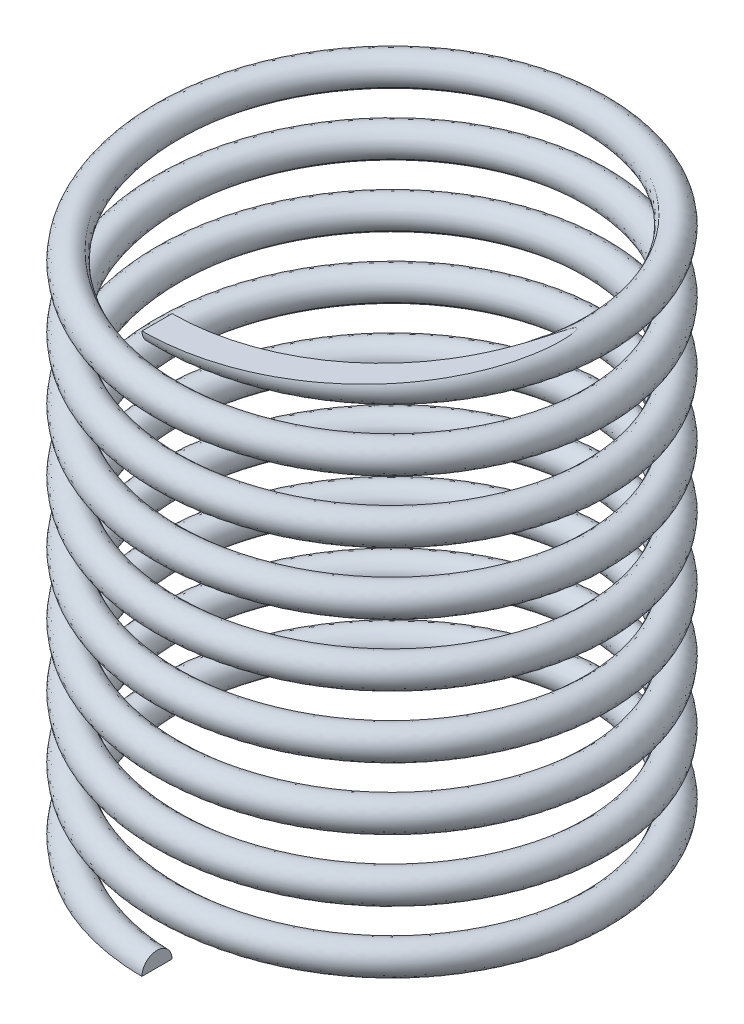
ISO-10303-21;
HEADER;
FILE_DESCRIPTION(('STEP AP214'),'2;1');
FILE_NAME('part.step','',(''),(''),'','','');
FILE_SCHEMA(('AUTOMOTIVE_DESIGN { 1 0 10303 214 1 1 1 1 }'));
ENDSEC;
DATA;
#1=APPLICATION_CONTEXT('core data for automotive mechanical design processes');
#2=APPLICATION_PROTOCOL_DEFINITION('international standard','automotive_design',2000,#1);
#3=PRODUCT_CONTEXT('',#1,'mechanical');
#4=PRODUCT('Part','Part','',(#3));
#5=PRODUCT_RELATED_PRODUCT_CATEGORY('part','',(#4));
#6=PRODUCT_DEFINITION_FORMATION('','',#4);
#7=PRODUCT_DEFINITION_CONTEXT('part definition',#1,'design');
#8=PRODUCT_DEFINITION('design','',#6,#7);
#9=PRODUCT_DEFINITION_SHAPE('','',#8);
#10=(LENGTH_UNIT() NAMED_UNIT(*) SI_UNIT(.MILLI.,.METRE.));
#11=(NAMED_UNIT(*) PLANE_ANGLE_UNIT() SI_UNIT($,.RADIAN.));
#12=(NAMED_UNIT(*) SI_UNIT($,.STERADIAN.) SOLID_ANGLE_UNIT());
#13=UNCERTAINTY_MEASURE_WITH_UNIT(LENGTH_MEASURE(1.E-05),#10,'distance_accuracy_value','');
#14=(GEOMETRIC_REPRESENTATION_CONTEXT(3) GLOBAL_UNCERTAINTY_ASSIGNED_CONTEXT((#13)) GLOBAL_UNIT_ASSIGNED_CONTEXT((#10,
#11,#12)) REPRESENTATION_CONTEXT('',''));
#15=CARTESIAN_POINT('',(0.,0.,0.));
#16=DIRECTION('',(0.,0.,1.));
#17=DIRECTION('',(1.,0.,0.));
#18=AXIS2_PLACEMENT_3D('',#15,#16,#17);
#19=CARTESIAN_POINT('',(0.,0.,2.5));
#20=DIRECTION('',(1.,0.,0.));
#21=DIRECTION('',(0.,0.,-1.));
#22=AXIS2_PLACEMENT_3D('',#19,#20,#21);
#23=PLANE('',#22);
#24=DIRECTION('',(0.,0.,1.));
#25=VECTOR('',#24,1.);
#26=CARTESIAN_POINT('',(0.,0.,-5.));
#27=LINE('',#26,#25);
#28=CARTESIAN_POINT('',(0.,0.,2.325));
#29=VERTEX_POINT('',#28);
#30=CARTESIAN_POINT('',(0.,0.,2.675));
#31=VERTEX_POINT('',#30);
#32=EDGE_CURVE('E53',#29,#31,#27,.T.);
#33=ORIENTED_EDGE('',*,*,#32,.F.);
#34=CARTESIAN_POINT('',(0.,0.,2.5));
#35=DIRECTION('',(1.,0.,0.));
#36=DIRECTION('',(0.,0.,-1.));
#37=AXIS2_PLACEMENT_3D('',#34,#35,#36);
#38=CIRCLE('',#37,0.175);
#39=EDGE_CURVE('E67',#29,#31,#38,.T.);
#40=ORIENTED_EDGE('',*,*,#39,.T.);
#41=EDGE_LOOP('',(#33,#40));
#42=FACE_BOUND('',#41,.T.);
#43=ADVANCED_FACE('F26',(#42),#23,.T.);
#44=CARTESIAN_POINT('',(-3.14233320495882E-13,6.5,2.5));
#45=DIRECTION('',(1.,0.,1.25693328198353E-13));
#46=DIRECTION('',(1.25693328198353E-13,0.,-1.));
#47=AXIS2_PLACEMENT_3D('',#44,#45,#46);
#48=PLANE('',#47);
#49=CARTESIAN_POINT('',(-3.14233320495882E-13,6.5,2.5));
#50=DIRECTION('',(1.,0.,1.25693328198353E-13));
#51=DIRECTION('',(1.25693328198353E-13,0.,-1.));
#52=AXIS2_PLACEMENT_3D('',#49,#50,#51);
#53=CIRCLE('',#52,0.175);
#54=CARTESIAN_POINT('',(-3.36229652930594E-13,6.5,2.675));
#55=VERTEX_POINT('',#54);
#56=CARTESIAN_POINT('',(-2.93333356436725E-13,6.5,2.325));
#57=VERTEX_POINT('',#56);
#58=EDGE_CURVE('E64',#55,#57,#53,.T.);
#59=ORIENTED_EDGE('',*,*,#58,.F.);
#60=DIRECTION('',(0.,0.,1.));
#61=VECTOR('',#60,1.);
#62=CARTESIAN_POINT('',(-2.93333356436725E-13,6.5,-5.));
#63=LINE('',#62,#61);
#64=EDGE_CURVE('E47',#57,#55,#63,.T.);
#65=ORIENTED_EDGE('',*,*,#64,.F.);
#66=EDGE_LOOP('',(#59,#65));
#67=FACE_BOUND('',#66,.T.);
#68=ADVANCED_FACE('F63',(#67),#48,.F.);
#69=CARTESIAN_POINT('',(0.,0.,2.325));
#70=CARTESIAN_POINT('',(-1.34233937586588,0.060185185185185,2.325));
#71=CARTESIAN_POINT('',(-2.01350906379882,0.12037037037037,1.1625));
#72=CARTESIAN_POINT('',(-2.68467875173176,0.180555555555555,0.));
#73=CARTESIAN_POINT('',(-2.01350906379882,0.24074074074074,-1.1625));
#74=CARTESIAN_POINT('',(-1.34233937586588,0.300925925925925,-2.325));
#75=CARTESIAN_POINT('',(0.,0.36111111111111,-2.325));
#76=CARTESIAN_POINT('',(1.34233937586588,0.421296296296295,-2.325));
#77=CARTESIAN_POINT('',(2.01350906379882,0.48148148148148,-1.1625));
#78=CARTESIAN_POINT('',(2.68467875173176,0.541666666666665,0.));
#79=CARTESIAN_POINT('',(2.01350906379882,0.60185185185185,1.1625));
#80=CARTESIAN_POINT('',(1.34233937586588,0.662037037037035,2.325));
#81=CARTESIAN_POINT('',(0.,0.72222222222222,2.325));
#82=CARTESIAN_POINT('',(-1.34233937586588,0.782407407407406,2.325));
#83=CARTESIAN_POINT('',(-2.01350906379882,0.842592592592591,1.1625));
#84=CARTESIAN_POINT('',(-2.68467875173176,0.902777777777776,0.));
#85=CARTESIAN_POINT('',(-2.01350906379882,0.962962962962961,-1.1625));
#86=CARTESIAN_POINT('',(-1.34233937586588,1.02314814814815,-2.325));
#87=CARTESIAN_POINT('',(0.,1.08333333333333,-2.325));
#88=CARTESIAN_POINT('',(1.34233937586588,1.14351851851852,-2.325));
#89=CARTESIAN_POINT('',(2.01350906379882,1.2037037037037,-1.1625));
#90=CARTESIAN_POINT('',(2.68467875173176,1.26388888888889,0.));
#91=CARTESIAN_POINT('',(2.01350906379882,1.32407407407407,1.1625));
#92=CARTESIAN_POINT('',(1.34233937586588,1.38425925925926,2.325));
#93=CARTESIAN_POINT('',(0.,1.44444444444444,2.325));
#94=CARTESIAN_POINT('',(-1.34233937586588,1.50462962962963,2.325));
#95=CARTESIAN_POINT('',(-2.01350906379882,1.56481481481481,1.1625));
#96=CARTESIAN_POINT('',(-2.68467875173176,1.625,0.));
#97=CARTESIAN_POINT('',(-2.01350906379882,1.68518518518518,-1.1625));
#98=CARTESIAN_POINT('',(-1.34233937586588,1.74537037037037,-2.325));
#99=CARTESIAN_POINT('',(0.,1.80555555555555,-2.325));
#100=CARTESIAN_POINT('',(1.34233937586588,1.86574074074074,-2.325));
#101=CARTESIAN_POINT('',(2.01350906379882,1.92592592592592,-1.1625));
#102=CARTESIAN_POINT('',(2.68467875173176,1.98611111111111,0.));
#103=CARTESIAN_POINT('',(2.01350906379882,2.04629629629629,1.1625));
#104=CARTESIAN_POINT('',(1.34233937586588,2.10648148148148,2.325));
#105=CARTESIAN_POINT('',(0.,2.16666666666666,2.325));
#106=CARTESIAN_POINT('',(-1.34233937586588,2.22685185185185,2.325));
#107=CARTESIAN_POINT('',(-2.01350906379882,2.28703703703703,1.1625));
#108=CARTESIAN_POINT('',(-2.68467875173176,2.34722222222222,0.));
#109=CARTESIAN_POINT('',(-2.01350906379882,2.4074074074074,-1.1625));
#110=CARTESIAN_POINT('',(-1.34233937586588,2.46759259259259,-2.325));
#111=CARTESIAN_POINT('',(0.,2.52777777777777,-2.325));
#112=CARTESIAN_POINT('',(1.34233937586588,2.58796296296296,-2.325));
#113=CARTESIAN_POINT('',(2.01350906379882,2.64814814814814,-1.1625));
#114=CARTESIAN_POINT('',(2.68467875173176,2.70833333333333,0.));
#115=CARTESIAN_POINT('',(2.01350906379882,2.76851851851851,1.1625));
#116=CARTESIAN_POINT('',(1.34233937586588,2.8287037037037,2.325));
#117=CARTESIAN_POINT('',(0.,2.88888888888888,2.325));
#118=CARTESIAN_POINT('',(-1.34233937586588,2.94907407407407,2.325));
#119=CARTESIAN_POINT('',(-2.01350906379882,3.00925925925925,1.1625));
#120=CARTESIAN_POINT('',(-2.68467875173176,3.06944444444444,0.));
#121=CARTESIAN_POINT('',(-2.01350906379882,3.12962962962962,-1.1625));
#122=CARTESIAN_POINT('',(-1.34233937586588,3.18981481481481,-2.325));
#123=CARTESIAN_POINT('',(0.,3.24999999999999,-2.325));
#124=CARTESIAN_POINT('',(1.34233937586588,3.31018518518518,-2.325));
#125=CARTESIAN_POINT('',(2.01350906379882,3.37037037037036,-1.1625));
#126=CARTESIAN_POINT('',(2.68467875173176,3.43055555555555,0.));
#127=CARTESIAN_POINT('',(2.01350906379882,3.49074074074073,1.1625));
#128=CARTESIAN_POINT('',(1.34233937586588,3.55092592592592,2.325));
#129=CARTESIAN_POINT('',(0.,3.6111111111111,2.325));
#130=CARTESIAN_POINT('',(-1.34233937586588,3.67129629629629,2.325));
#131=CARTESIAN_POINT('',(-2.01350906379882,3.73148148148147,1.1625));
#132=CARTESIAN_POINT('',(-2.68467875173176,3.79166666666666,0.));
#133=CARTESIAN_POINT('',(-2.01350906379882,3.85185185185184,-1.1625));
#134=CARTESIAN_POINT('',(-1.34233937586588,3.91203703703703,-2.325));
#135=CARTESIAN_POINT('',(0.,3.97222222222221,-2.325));
#136=CARTESIAN_POINT('',(1.34233937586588,4.0324074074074,-2.325));
#137=CARTESIAN_POINT('',(2.01350906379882,4.09259259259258,-1.1625));
#138=CARTESIAN_POINT('',(2.68467875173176,4.15277777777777,0.));
#139=CARTESIAN_POINT('',(2.01350906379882,4.21296296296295,1.1625));
#140=CARTESIAN_POINT('',(1.34233937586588,4.27314814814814,2.325));
#141=CARTESIAN_POINT('',(0.,4.33333333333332,2.325));
#142=CARTESIAN_POINT('',(-1.34233937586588,4.39351851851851,2.325));
#143=CARTESIAN_POINT('',(-2.01350906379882,4.45370370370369,1.1625));
#144=CARTESIAN_POINT('',(-2.68467875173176,4.51388888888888,0.));
#145=CARTESIAN_POINT('',(-2.01350906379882,4.57407407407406,-1.1625));
#146=CARTESIAN_POINT('',(-1.34233937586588,4.63425925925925,-2.325));
#147=CARTESIAN_POINT('',(0.,4.69444444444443,-2.325));
#148=CARTESIAN_POINT('',(1.34233937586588,4.75462962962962,-2.325));
#149=CARTESIAN_POINT('',(2.01350906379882,4.8148148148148,-1.1625));
#150=CARTESIAN_POINT('',(2.68467875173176,4.87499999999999,0.));
#151=CARTESIAN_POINT('',(2.01350906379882,4.93518518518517,1.1625));
#152=CARTESIAN_POINT('',(1.34233937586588,4.99537037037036,2.325));
#153=CARTESIAN_POINT('',(0.,5.05555555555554,2.325));
#154=CARTESIAN_POINT('',(-1.34233937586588,5.11574074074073,2.325));
#155=CARTESIAN_POINT('',(-2.01350906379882,5.17592592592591,1.1625));
#156=CARTESIAN_POINT('',(-2.68467875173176,5.2361111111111,0.));
#157=CARTESIAN_POINT('',(-2.01350906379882,5.29629629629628,-1.1625));
#158=CARTESIAN_POINT('',(-1.34233937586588,5.35648148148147,-2.325));
#159=CARTESIAN_POINT('',(0.,5.41666666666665,-2.325));
#160=CARTESIAN_POINT('',(1.34233937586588,5.47685185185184,-2.325));
#161=CARTESIAN_POINT('',(2.01350906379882,5.53703703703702,-1.1625));
#162=CARTESIAN_POINT('',(2.68467875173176,5.59722222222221,0.));
#163=CARTESIAN_POINT('',(2.01350906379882,5.65740740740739,1.1625));
#164=CARTESIAN_POINT('',(1.34233937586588,5.71759259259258,2.325));
#165=CARTESIAN_POINT('',(0.,5.77777777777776,2.325));
#166=CARTESIAN_POINT('',(-1.34233937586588,5.83796296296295,2.325));
#167=CARTESIAN_POINT('',(-2.01350906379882,5.89814814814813,1.1625));
#168=CARTESIAN_POINT('',(-2.68467875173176,5.95833333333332,0.));
#169=CARTESIAN_POINT('',(-2.01350906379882,6.0185185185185,-1.1625));
#170=CARTESIAN_POINT('',(-1.34233937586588,6.07870370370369,-2.325));
#171=CARTESIAN_POINT('',(0.,6.13888888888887,-2.325));
#172=CARTESIAN_POINT('',(1.34233937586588,6.19907407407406,-2.325));
#173=CARTESIAN_POINT('',(2.01350906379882,6.25925925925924,-1.1625));
#174=CARTESIAN_POINT('',(2.68467875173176,6.31944444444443,0.));
#175=CARTESIAN_POINT('',(2.01350906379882,6.37962962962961,1.1625));
#176=CARTESIAN_POINT('',(1.34233937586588,6.4398148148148,2.325));
#177=CARTESIAN_POINT('',(0.,6.49999999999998,2.325));
#178=CARTESIAN_POINT('',(-1.34233937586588,6.56018518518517,2.325));
#179=CARTESIAN_POINT('',(-2.01350906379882,6.62037037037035,1.1625));
#180=CARTESIAN_POINT('',(-2.68467875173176,6.68055555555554,0.));
#181=CARTESIAN_POINT('',(-2.01350906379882,6.74074074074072,-1.1625));
#182=CARTESIAN_POINT('',(-1.34233937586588,6.80092592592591,-2.325));
#183=CARTESIAN_POINT('',(0.,6.86111111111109,-2.325));
#184=CARTESIAN_POINT('',(1.34233937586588,6.92129629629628,-2.325));
#185=CARTESIAN_POINT('',(2.01350906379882,6.98148148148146,-1.1625));
#186=CARTESIAN_POINT('',(2.68467875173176,7.04166666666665,0.));
#187=CARTESIAN_POINT('',(2.01350906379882,7.10185185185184,1.1625));
#188=CARTESIAN_POINT('',(1.34233937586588,7.16203703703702,2.325));
#189=CARTESIAN_POINT('',(0.,7.2222222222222,2.325));
#190=CARTESIAN_POINT('',(0.,0.350000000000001,2.325));
#191=CARTESIAN_POINT('',(-1.34233937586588,0.410185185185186,2.325));
#192=CARTESIAN_POINT('',(-2.01350906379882,0.470370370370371,1.1625));
#193=CARTESIAN_POINT('',(-2.68467875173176,0.530555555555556,0.));
#194=CARTESIAN_POINT('',(-2.01350906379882,0.590740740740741,-1.1625));
#195=CARTESIAN_POINT('',(-1.34233937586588,0.650925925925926,-2.325));
#196=CARTESIAN_POINT('',(0.,0.711111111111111,-2.325));
#197=CARTESIAN_POINT('',(1.34233937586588,0.771296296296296,-2.325));
#198=CARTESIAN_POINT('',(2.01350906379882,0.831481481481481,-1.1625));
#199=CARTESIAN_POINT('',(2.68467875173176,0.891666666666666,0.));
#200=CARTESIAN_POINT('',(2.01350906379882,0.951851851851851,1.1625));
#201=CARTESIAN_POINT('',(1.34233937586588,1.01203703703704,2.325));
#202=CARTESIAN_POINT('',(0.,1.07222222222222,2.325));
#203=CARTESIAN_POINT('',(-1.34233937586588,1.13240740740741,2.325));
#204=CARTESIAN_POINT('',(-2.01350906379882,1.19259259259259,1.1625));
#205=CARTESIAN_POINT('',(-2.68467875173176,1.25277777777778,0.));
#206=CARTESIAN_POINT('',(-2.01350906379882,1.31296296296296,-1.1625));
#207=CARTESIAN_POINT('',(-1.34233937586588,1.37314814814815,-2.325));
#208=CARTESIAN_POINT('',(0.,1.43333333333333,-2.325));
#209=CARTESIAN_POINT('',(1.34233937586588,1.49351851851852,-2.325));
#210=CARTESIAN_POINT('',(2.01350906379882,1.5537037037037,-1.1625));
#211=CARTESIAN_POINT('',(2.68467875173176,1.61388888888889,0.));
#212=CARTESIAN_POINT('',(2.01350906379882,1.67407407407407,1.1625));
#213=CARTESIAN_POINT('',(1.34233937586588,1.73425925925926,2.325));
#214=CARTESIAN_POINT('',(0.,1.79444444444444,2.325));
#215=CARTESIAN_POINT('',(-1.34233937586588,1.85462962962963,2.325));
#216=CARTESIAN_POINT('',(-2.01350906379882,1.91481481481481,1.1625));
#217=CARTESIAN_POINT('',(-2.68467875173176,1.975,0.));
#218=CARTESIAN_POINT('',(-2.01350906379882,2.03518518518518,-1.1625));
#219=CARTESIAN_POINT('',(-1.34233937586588,2.09537037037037,-2.325));
#220=CARTESIAN_POINT('',(0.,2.15555555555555,-2.325));
#221=CARTESIAN_POINT('',(1.34233937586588,2.21574074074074,-2.325));
#222=CARTESIAN_POINT('',(2.01350906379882,2.27592592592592,-1.1625));
#223=CARTESIAN_POINT('',(2.68467875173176,2.33611111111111,0.));
#224=CARTESIAN_POINT('',(2.01350906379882,2.39629629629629,1.1625));
#225=CARTESIAN_POINT('',(1.34233937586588,2.45648148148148,2.325));
#226=CARTESIAN_POINT('',(0.,2.51666666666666,2.325));
#227=CARTESIAN_POINT('',(-1.34233937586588,2.57685185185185,2.325));
#228=CARTESIAN_POINT('',(-2.01350906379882,2.63703703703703,1.1625));
#229=CARTESIAN_POINT('',(-2.68467875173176,2.69722222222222,0.));
#230=CARTESIAN_POINT('',(-2.01350906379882,2.7574074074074,-1.1625));
#231=CARTESIAN_POINT('',(-1.34233937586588,2.81759259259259,-2.325));
#232=CARTESIAN_POINT('',(0.,2.87777777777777,-2.325));
#233=CARTESIAN_POINT('',(1.34233937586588,2.93796296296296,-2.325));
#234=CARTESIAN_POINT('',(2.01350906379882,2.99814814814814,-1.1625));
#235=CARTESIAN_POINT('',(2.68467875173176,3.05833333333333,0.));
#236=CARTESIAN_POINT('',(2.01350906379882,3.11851851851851,1.1625));
#237=CARTESIAN_POINT('',(1.34233937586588,3.1787037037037,2.325));
#238=CARTESIAN_POINT('',(0.,3.23888888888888,2.325));
#239=CARTESIAN_POINT('',(-1.34233937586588,3.29907407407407,2.325));
#240=CARTESIAN_POINT('',(-2.01350906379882,3.35925925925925,1.1625));
#241=CARTESIAN_POINT('',(-2.68467875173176,3.41944444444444,0.));
#242=CARTESIAN_POINT('',(-2.01350906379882,3.47962962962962,-1.1625));
#243=CARTESIAN_POINT('',(-1.34233937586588,3.53981481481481,-2.325));
#244=CARTESIAN_POINT('',(0.,3.59999999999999,-2.325));
#245=CARTESIAN_POINT('',(1.34233937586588,3.66018518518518,-2.325));
#246=CARTESIAN_POINT('',(2.01350906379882,3.72037037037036,-1.1625));
#247=CARTESIAN_POINT('',(2.68467875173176,3.78055555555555,0.));
#248=CARTESIAN_POINT('',(2.01350906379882,3.84074074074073,1.1625));
#249=CARTESIAN_POINT('',(1.34233937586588,3.90092592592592,2.325));
#250=CARTESIAN_POINT('',(0.,3.9611111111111,2.325));
#251=CARTESIAN_POINT('',(-1.34233937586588,4.02129629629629,2.325));
#252=CARTESIAN_POINT('',(-2.01350906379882,4.08148148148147,1.1625));
#253=CARTESIAN_POINT('',(-2.68467875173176,4.14166666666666,0.));
#254=CARTESIAN_POINT('',(-2.01350906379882,4.20185185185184,-1.1625));
#255=CARTESIAN_POINT('',(-1.34233937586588,4.26203703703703,-2.325));
#256=CARTESIAN_POINT('',(0.,4.32222222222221,-2.325));
#257=CARTESIAN_POINT('',(1.34233937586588,4.3824074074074,-2.325));
#258=CARTESIAN_POINT('',(2.01350906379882,4.44259259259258,-1.1625));
#259=CARTESIAN_POINT('',(2.68467875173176,4.50277777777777,0.));
#260=CARTESIAN_POINT('',(2.01350906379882,4.56296296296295,1.1625));
#261=CARTESIAN_POINT('',(1.34233937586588,4.62314814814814,2.325));
#262=CARTESIAN_POINT('',(0.,4.68333333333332,2.325));
#263=CARTESIAN_POINT('',(-1.34233937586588,4.74351851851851,2.325));
#264=CARTESIAN_POINT('',(-2.01350906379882,4.80370370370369,1.1625));
#265=CARTESIAN_POINT('',(-2.68467875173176,4.86388888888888,0.));
#266=CARTESIAN_POINT('',(-2.01350906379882,4.92407407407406,-1.1625));
#267=CARTESIAN_POINT('',(-1.34233937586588,4.98425925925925,-2.325));
#268=CARTESIAN_POINT('',(0.,5.04444444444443,-2.325));
#269=CARTESIAN_POINT('',(1.34233937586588,5.10462962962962,-2.325));
#270=CARTESIAN_POINT('',(2.01350906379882,5.1648148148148,-1.1625));
#271=CARTESIAN_POINT('',(2.68467875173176,5.22499999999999,0.));
#272=CARTESIAN_POINT('',(2.01350906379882,5.28518518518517,1.1625));
#273=CARTESIAN_POINT('',(1.34233937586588,5.34537037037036,2.325));
#274=CARTESIAN_POINT('',(0.,5.40555555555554,2.325));
#275=CARTESIAN_POINT('',(-1.34233937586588,5.46574074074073,2.325));
#276=CARTESIAN_POINT('',(-2.01350906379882,5.52592592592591,1.1625));
#277=CARTESIAN_POINT('',(-2.68467875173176,5.5861111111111,0.));
#278=CARTESIAN_POINT('',(-2.01350906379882,5.64629629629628,-1.1625));
#279=CARTESIAN_POINT('',(-1.34233937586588,5.70648148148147,-2.325));
#280=CARTESIAN_POINT('',(0.,5.76666666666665,-2.325));
#281=CARTESIAN_POINT('',(1.34233937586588,5.82685185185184,-2.325));
#282=CARTESIAN_POINT('',(2.01350906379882,5.88703703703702,-1.1625));
#283=CARTESIAN_POINT('',(2.68467875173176,5.94722222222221,0.));
#284=CARTESIAN_POINT('',(2.01350906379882,6.00740740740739,1.1625));
#285=CARTESIAN_POINT('',(1.34233937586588,6.06759259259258,2.325));
#286=CARTESIAN_POINT('',(0.,6.12777777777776,2.325));
#287=CARTESIAN_POINT('',(-1.34233937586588,6.18796296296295,2.325));
#288=CARTESIAN_POINT('',(-2.01350906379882,6.24814814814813,1.1625));
#289=CARTESIAN_POINT('',(-2.68467875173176,6.30833333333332,0.));
#290=CARTESIAN_POINT('',(-2.01350906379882,6.3685185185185,-1.1625));
#291=CARTESIAN_POINT('',(-1.34233937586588,6.42870370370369,-2.325));
#292=CARTESIAN_POINT('',(0.,6.48888888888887,-2.325));
#293=CARTESIAN_POINT('',(1.34233937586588,6.54907407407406,-2.325));
#294=CARTESIAN_POINT('',(2.01350906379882,6.60925925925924,-1.1625));
#295=CARTESIAN_POINT('',(2.68467875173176,6.66944444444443,0.));
#296=CARTESIAN_POINT('',(2.01350906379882,6.72962962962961,1.1625));
#297=CARTESIAN_POINT('',(1.34233937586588,6.7898148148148,2.325));
#298=CARTESIAN_POINT('',(0.,6.84999999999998,2.325));
#299=CARTESIAN_POINT('',(-1.34233937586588,6.91018518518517,2.325));
#300=CARTESIAN_POINT('',(-2.01350906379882,6.97037037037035,1.1625));
#301=CARTESIAN_POINT('',(-2.68467875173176,7.03055555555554,0.));
#302=CARTESIAN_POINT('',(-2.01350906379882,7.09074074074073,-1.1625));
#303=CARTESIAN_POINT('',(-1.34233937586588,7.15092592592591,-2.325));
#304=CARTESIAN_POINT('',(0.,7.21111111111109,-2.325));
#305=CARTESIAN_POINT('',(1.34233937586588,7.27129629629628,-2.325));
#306=CARTESIAN_POINT('',(2.01350906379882,7.33148148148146,-1.1625));
#307=CARTESIAN_POINT('',(2.68467875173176,7.39166666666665,0.));
#308=CARTESIAN_POINT('',(2.01350906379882,7.45185185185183,1.1625));
#309=CARTESIAN_POINT('',(1.34233937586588,7.51203703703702,2.325));
#310=CARTESIAN_POINT('',(0.,7.57222222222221,2.325));
#311=CARTESIAN_POINT('',(0.,0.350000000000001,2.675));
#312=CARTESIAN_POINT('',(-1.54441197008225,0.410185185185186,2.675));
#313=CARTESIAN_POINT('',(-2.31661795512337,0.470370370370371,1.3375));
#314=CARTESIAN_POINT('',(-3.0888239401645,0.530555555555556,0.));
#315=CARTESIAN_POINT('',(-2.31661795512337,0.590740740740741,-1.3375));
#316=CARTESIAN_POINT('',(-1.54441197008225,0.650925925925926,-2.675));
#317=CARTESIAN_POINT('',(0.,0.711111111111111,-2.675));
#318=CARTESIAN_POINT('',(1.54441197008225,0.771296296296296,-2.675));
#319=CARTESIAN_POINT('',(2.31661795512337,0.831481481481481,-1.3375));
#320=CARTESIAN_POINT('',(3.0888239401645,0.891666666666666,0.));
#321=CARTESIAN_POINT('',(2.31661795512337,0.951851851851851,1.3375));
#322=CARTESIAN_POINT('',(1.54441197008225,1.01203703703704,2.675));
#323=CARTESIAN_POINT('',(0.,1.07222222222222,2.675));
#324=CARTESIAN_POINT('',(-1.54441197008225,1.13240740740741,2.675));
#325=CARTESIAN_POINT('',(-2.31661795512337,1.19259259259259,1.3375));
#326=CARTESIAN_POINT('',(-3.0888239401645,1.25277777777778,0.));
#327=CARTESIAN_POINT('',(-2.31661795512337,1.31296296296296,-1.3375));
#328=CARTESIAN_POINT('',(-1.54441197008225,1.37314814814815,-2.675));
#329=CARTESIAN_POINT('',(0.,1.43333333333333,-2.675));
#330=CARTESIAN_POINT('',(1.54441197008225,1.49351851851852,-2.675));
#331=CARTESIAN_POINT('',(2.31661795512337,1.5537037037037,-1.3375));
#332=CARTESIAN_POINT('',(3.0888239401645,1.61388888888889,0.));
#333=CARTESIAN_POINT('',(2.31661795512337,1.67407407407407,1.3375));
#334=CARTESIAN_POINT('',(1.54441197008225,1.73425925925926,2.675));
#335=CARTESIAN_POINT('',(0.,1.79444444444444,2.675));
#336=CARTESIAN_POINT('',(-1.54441197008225,1.85462962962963,2.675));
#337=CARTESIAN_POINT('',(-2.31661795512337,1.91481481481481,1.3375));
#338=CARTESIAN_POINT('',(-3.0888239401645,1.975,0.));
#339=CARTESIAN_POINT('',(-2.31661795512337,2.03518518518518,-1.3375));
#340=CARTESIAN_POINT('',(-1.54441197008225,2.09537037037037,-2.675));
#341=CARTESIAN_POINT('',(0.,2.15555555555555,-2.675));
#342=CARTESIAN_POINT('',(1.54441197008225,2.21574074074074,-2.675));
#343=CARTESIAN_POINT('',(2.31661795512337,2.27592592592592,-1.3375));
#344=CARTESIAN_POINT('',(3.0888239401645,2.33611111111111,0.));
#345=CARTESIAN_POINT('',(2.31661795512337,2.39629629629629,1.3375));
#346=CARTESIAN_POINT('',(1.54441197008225,2.45648148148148,2.675));
#347=CARTESIAN_POINT('',(0.,2.51666666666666,2.675));
#348=CARTESIAN_POINT('',(-1.54441197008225,2.57685185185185,2.675));
#349=CARTESIAN_POINT('',(-2.31661795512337,2.63703703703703,1.3375));
#350=CARTESIAN_POINT('',(-3.0888239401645,2.69722222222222,0.));
#351=CARTESIAN_POINT('',(-2.31661795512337,2.7574074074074,-1.3375));
#352=CARTESIAN_POINT('',(-1.54441197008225,2.81759259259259,-2.675));
#353=CARTESIAN_POINT('',(0.,2.87777777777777,-2.675));
#354=CARTESIAN_POINT('',(1.54441197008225,2.93796296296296,-2.675));
#355=CARTESIAN_POINT('',(2.31661795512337,2.99814814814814,-1.3375));
#356=CARTESIAN_POINT('',(3.0888239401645,3.05833333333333,0.));
#357=CARTESIAN_POINT('',(2.31661795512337,3.11851851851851,1.3375));
#358=CARTESIAN_POINT('',(1.54441197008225,3.1787037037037,2.675));
#359=CARTESIAN_POINT('',(0.,3.23888888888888,2.675));
#360=CARTESIAN_POINT('',(-1.54441197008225,3.29907407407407,2.675));
#361=CARTESIAN_POINT('',(-2.31661795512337,3.35925925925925,1.3375));
#362=CARTESIAN_POINT('',(-3.0888239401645,3.41944444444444,0.));
#363=CARTESIAN_POINT('',(-2.31661795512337,3.47962962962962,-1.3375));
#364=CARTESIAN_POINT('',(-1.54441197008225,3.53981481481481,-2.675));
#365=CARTESIAN_POINT('',(0.,3.59999999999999,-2.675));
#366=CARTESIAN_POINT('',(1.54441197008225,3.66018518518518,-2.675));
#367=CARTESIAN_POINT('',(2.31661795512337,3.72037037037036,-1.3375));
#368=CARTESIAN_POINT('',(3.0888239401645,3.78055555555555,0.));
#369=CARTESIAN_POINT('',(2.31661795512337,3.84074074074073,1.3375));
#370=CARTESIAN_POINT('',(1.54441197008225,3.90092592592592,2.675));
#371=CARTESIAN_POINT('',(0.,3.9611111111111,2.675));
#372=CARTESIAN_POINT('',(-1.54441197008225,4.02129629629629,2.675));
#373=CARTESIAN_POINT('',(-2.31661795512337,4.08148148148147,1.3375));
#374=CARTESIAN_POINT('',(-3.0888239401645,4.14166666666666,0.));
#375=CARTESIAN_POINT('',(-2.31661795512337,4.20185185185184,-1.3375));
#376=CARTESIAN_POINT('',(-1.54441197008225,4.26203703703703,-2.675));
#377=CARTESIAN_POINT('',(0.,4.32222222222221,-2.675));
#378=CARTESIAN_POINT('',(1.54441197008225,4.3824074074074,-2.675));
#379=CARTESIAN_POINT('',(2.31661795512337,4.44259259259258,-1.3375));
#380=CARTESIAN_POINT('',(3.0888239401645,4.50277777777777,0.));
#381=CARTESIAN_POINT('',(2.31661795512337,4.56296296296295,1.3375));
#382=CARTESIAN_POINT('',(1.54441197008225,4.62314814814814,2.675));
#383=CARTESIAN_POINT('',(0.,4.68333333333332,2.675));
#384=CARTESIAN_POINT('',(-1.54441197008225,4.74351851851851,2.675));
#385=CARTESIAN_POINT('',(-2.31661795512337,4.80370370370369,1.3375));
#386=CARTESIAN_POINT('',(-3.0888239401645,4.86388888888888,0.));
#387=CARTESIAN_POINT('',(-2.31661795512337,4.92407407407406,-1.3375));
#388=CARTESIAN_POINT('',(-1.54441197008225,4.98425925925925,-2.675));
#389=CARTESIAN_POINT('',(0.,5.04444444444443,-2.675));
#390=CARTESIAN_POINT('',(1.54441197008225,5.10462962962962,-2.675));
#391=CARTESIAN_POINT('',(2.31661795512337,5.1648148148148,-1.3375));
#392=CARTESIAN_POINT('',(3.0888239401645,5.22499999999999,0.));
#393=CARTESIAN_POINT('',(2.31661795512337,5.28518518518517,1.3375));
#394=CARTESIAN_POINT('',(1.54441197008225,5.34537037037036,2.675));
#395=CARTESIAN_POINT('',(0.,5.40555555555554,2.675));
#396=CARTESIAN_POINT('',(-1.54441197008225,5.46574074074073,2.675));
#397=CARTESIAN_POINT('',(-2.31661795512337,5.52592592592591,1.3375));
#398=CARTESIAN_POINT('',(-3.0888239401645,5.5861111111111,0.));
#399=CARTESIAN_POINT('',(-2.31661795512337,5.64629629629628,-1.3375));
#400=CARTESIAN_POINT('',(-1.54441197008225,5.70648148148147,-2.675));
#401=CARTESIAN_POINT('',(0.,5.76666666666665,-2.675));
#402=CARTESIAN_POINT('',(1.54441197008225,5.82685185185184,-2.675));
#403=CARTESIAN_POINT('',(2.31661795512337,5.88703703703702,-1.3375));
#404=CARTESIAN_POINT('',(3.0888239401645,5.94722222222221,0.));
#405=CARTESIAN_POINT('',(2.31661795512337,6.00740740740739,1.3375));
#406=CARTESIAN_POINT('',(1.54441197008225,6.06759259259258,2.675));
#407=CARTESIAN_POINT('',(0.,6.12777777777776,2.675));
#408=CARTESIAN_POINT('',(-1.54441197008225,6.18796296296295,2.675));
#409=CARTESIAN_POINT('',(-2.31661795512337,6.24814814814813,1.3375));
#410=CARTESIAN_POINT('',(-3.0888239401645,6.30833333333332,0.));
#411=CARTESIAN_POINT('',(-2.31661795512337,6.3685185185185,-1.3375));
#412=CARTESIAN_POINT('',(-1.54441197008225,6.42870370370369,-2.675));
#413=CARTESIAN_POINT('',(0.,6.48888888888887,-2.675));
#414=CARTESIAN_POINT('',(1.54441197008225,6.54907407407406,-2.675));
#415=CARTESIAN_POINT('',(2.31661795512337,6.60925925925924,-1.3375));
#416=CARTESIAN_POINT('',(3.0888239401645,6.66944444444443,0.));
#417=CARTESIAN_POINT('',(2.31661795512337,6.72962962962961,1.3375));
#418=CARTESIAN_POINT('',(1.54441197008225,6.7898148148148,2.675));
#419=CARTESIAN_POINT('',(0.,6.84999999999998,2.675));
#420=CARTESIAN_POINT('',(-1.54441197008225,6.91018518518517,2.675));
#421=CARTESIAN_POINT('',(-2.31661795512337,6.97037037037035,1.3375));
#422=CARTESIAN_POINT('',(-3.0888239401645,7.03055555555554,0.));
#423=CARTESIAN_POINT('',(-2.31661795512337,7.09074074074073,-1.3375));
#424=CARTESIAN_POINT('',(-1.54441197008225,7.15092592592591,-2.675));
#425=CARTESIAN_POINT('',(0.,7.21111111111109,-2.675));
#426=CARTESIAN_POINT('',(1.54441197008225,7.27129629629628,-2.675));
#427=CARTESIAN_POINT('',(2.31661795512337,7.33148148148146,-1.3375));
#428=CARTESIAN_POINT('',(3.0888239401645,7.39166666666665,0.));
#429=CARTESIAN_POINT('',(2.31661795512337,7.45185185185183,1.3375));
#430=CARTESIAN_POINT('',(1.54441197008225,7.51203703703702,2.675));
#431=CARTESIAN_POINT('',(0.,7.57222222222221,2.675));
#432=CARTESIAN_POINT('',(0.,0.,2.675));
#433=CARTESIAN_POINT('',(-1.54441197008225,0.0601851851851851,2.675));
#434=CARTESIAN_POINT('',(-2.31661795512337,0.12037037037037,1.3375));
#435=CARTESIAN_POINT('',(-3.0888239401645,0.180555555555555,0.));
#436=CARTESIAN_POINT('',(-2.31661795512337,0.24074074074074,-1.3375));
#437=CARTESIAN_POINT('',(-1.54441197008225,0.300925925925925,-2.675));
#438=CARTESIAN_POINT('',(0.,0.36111111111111,-2.675));
#439=CARTESIAN_POINT('',(1.54441197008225,0.421296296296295,-2.675));
#440=CARTESIAN_POINT('',(2.31661795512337,0.48148148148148,-1.3375));
#441=CARTESIAN_POINT('',(3.0888239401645,0.541666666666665,0.));
#442=CARTESIAN_POINT('',(2.31661795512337,0.60185185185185,1.3375));
#443=CARTESIAN_POINT('',(1.54441197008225,0.662037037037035,2.675));
#444=CARTESIAN_POINT('',(0.,0.72222222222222,2.675));
#445=CARTESIAN_POINT('',(-1.54441197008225,0.782407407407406,2.675));
#446=CARTESIAN_POINT('',(-2.31661795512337,0.842592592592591,1.3375));
#447=CARTESIAN_POINT('',(-3.0888239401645,0.902777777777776,0.));
#448=CARTESIAN_POINT('',(-2.31661795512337,0.962962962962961,-1.3375));
#449=CARTESIAN_POINT('',(-1.54441197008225,1.02314814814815,-2.675));
#450=CARTESIAN_POINT('',(0.,1.08333333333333,-2.675));
#451=CARTESIAN_POINT('',(1.54441197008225,1.14351851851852,-2.675));
#452=CARTESIAN_POINT('',(2.31661795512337,1.2037037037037,-1.3375));
#453=CARTESIAN_POINT('',(3.0888239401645,1.26388888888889,0.));
#454=CARTESIAN_POINT('',(2.31661795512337,1.32407407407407,1.3375));
#455=CARTESIAN_POINT('',(1.54441197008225,1.38425925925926,2.675));
#456=CARTESIAN_POINT('',(0.,1.44444444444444,2.675));
#457=CARTESIAN_POINT('',(-1.54441197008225,1.50462962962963,2.675));
#458=CARTESIAN_POINT('',(-2.31661795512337,1.56481481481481,1.3375));
#459=CARTESIAN_POINT('',(-3.0888239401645,1.625,0.));
#460=CARTESIAN_POINT('',(-2.31661795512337,1.68518518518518,-1.3375));
#461=CARTESIAN_POINT('',(-1.54441197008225,1.74537037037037,-2.675));
#462=CARTESIAN_POINT('',(0.,1.80555555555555,-2.675));
#463=CARTESIAN_POINT('',(1.54441197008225,1.86574074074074,-2.675));
#464=CARTESIAN_POINT('',(2.31661795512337,1.92592592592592,-1.3375));
#465=CARTESIAN_POINT('',(3.0888239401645,1.98611111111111,0.));
#466=CARTESIAN_POINT('',(2.31661795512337,2.04629629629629,1.3375));
#467=CARTESIAN_POINT('',(1.54441197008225,2.10648148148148,2.675));
#468=CARTESIAN_POINT('',(0.,2.16666666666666,2.675));
#469=CARTESIAN_POINT('',(-1.54441197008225,2.22685185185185,2.675));
#470=CARTESIAN_POINT('',(-2.31661795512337,2.28703703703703,1.3375));
#471=CARTESIAN_POINT('',(-3.0888239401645,2.34722222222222,0.));
#472=CARTESIAN_POINT('',(-2.31661795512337,2.4074074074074,-1.3375));
#473=CARTESIAN_POINT('',(-1.54441197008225,2.46759259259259,-2.675));
#474=CARTESIAN_POINT('',(0.,2.52777777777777,-2.675));
#475=CARTESIAN_POINT('',(1.54441197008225,2.58796296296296,-2.675));
#476=CARTESIAN_POINT('',(2.31661795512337,2.64814814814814,-1.3375));
#477=CARTESIAN_POINT('',(3.0888239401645,2.70833333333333,0.));
#478=CARTESIAN_POINT('',(2.31661795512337,2.76851851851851,1.3375));
#479=CARTESIAN_POINT('',(1.54441197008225,2.8287037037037,2.675));
#480=CARTESIAN_POINT('',(0.,2.88888888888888,2.675));
#481=CARTESIAN_POINT('',(-1.54441197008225,2.94907407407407,2.675));
#482=CARTESIAN_POINT('',(-2.31661795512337,3.00925925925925,1.3375));
#483=CARTESIAN_POINT('',(-3.0888239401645,3.06944444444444,0.));
#484=CARTESIAN_POINT('',(-2.31661795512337,3.12962962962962,-1.3375));
#485=CARTESIAN_POINT('',(-1.54441197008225,3.18981481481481,-2.675));
#486=CARTESIAN_POINT('',(0.,3.24999999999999,-2.675));
#487=CARTESIAN_POINT('',(1.54441197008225,3.31018518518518,-2.675));
#488=CARTESIAN_POINT('',(2.31661795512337,3.37037037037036,-1.3375));
#489=CARTESIAN_POINT('',(3.0888239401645,3.43055555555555,0.));
#490=CARTESIAN_POINT('',(2.31661795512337,3.49074074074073,1.3375));
#491=CARTESIAN_POINT('',(1.54441197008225,3.55092592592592,2.675));
#492=CARTESIAN_POINT('',(0.,3.6111111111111,2.675));
#493=CARTESIAN_POINT('',(-1.54441197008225,3.67129629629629,2.675));
#494=CARTESIAN_POINT('',(-2.31661795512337,3.73148148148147,1.3375));
#495=CARTESIAN_POINT('',(-3.0888239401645,3.79166666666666,0.));
#496=CARTESIAN_POINT('',(-2.31661795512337,3.85185185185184,-1.3375));
#497=CARTESIAN_POINT('',(-1.54441197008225,3.91203703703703,-2.675));
#498=CARTESIAN_POINT('',(0.,3.97222222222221,-2.675));
#499=CARTESIAN_POINT('',(1.54441197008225,4.0324074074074,-2.675));
#500=CARTESIAN_POINT('',(2.31661795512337,4.09259259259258,-1.3375));
#501=CARTESIAN_POINT('',(3.0888239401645,4.15277777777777,0.));
#502=CARTESIAN_POINT('',(2.31661795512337,4.21296296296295,1.3375));
#503=CARTESIAN_POINT('',(1.54441197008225,4.27314814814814,2.675));
#504=CARTESIAN_POINT('',(0.,4.33333333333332,2.675));
#505=CARTESIAN_POINT('',(-1.54441197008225,4.39351851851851,2.675));
#506=CARTESIAN_POINT('',(-2.31661795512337,4.45370370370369,1.3375));
#507=CARTESIAN_POINT('',(-3.0888239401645,4.51388888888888,0.));
#508=CARTESIAN_POINT('',(-2.31661795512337,4.57407407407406,-1.3375));
#509=CARTESIAN_POINT('',(-1.54441197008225,4.63425925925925,-2.675));
#510=CARTESIAN_POINT('',(0.,4.69444444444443,-2.675));
#511=CARTESIAN_POINT('',(1.54441197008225,4.75462962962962,-2.675));
#512=CARTESIAN_POINT('',(2.31661795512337,4.8148148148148,-1.3375));
#513=CARTESIAN_POINT('',(3.0888239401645,4.87499999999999,0.));
#514=CARTESIAN_POINT('',(2.31661795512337,4.93518518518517,1.3375));
#515=CARTESIAN_POINT('',(1.54441197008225,4.99537037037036,2.675));
#516=CARTESIAN_POINT('',(0.,5.05555555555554,2.675));
#517=CARTESIAN_POINT('',(-1.54441197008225,5.11574074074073,2.675));
#518=CARTESIAN_POINT('',(-2.31661795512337,5.17592592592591,1.3375));
#519=CARTESIAN_POINT('',(-3.0888239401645,5.2361111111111,0.));
#520=CARTESIAN_POINT('',(-2.31661795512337,5.29629629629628,-1.3375));
#521=CARTESIAN_POINT('',(-1.54441197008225,5.35648148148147,-2.675));
#522=CARTESIAN_POINT('',(0.,5.41666666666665,-2.675));
#523=CARTESIAN_POINT('',(1.54441197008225,5.47685185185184,-2.675));
#524=CARTESIAN_POINT('',(2.31661795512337,5.53703703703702,-1.3375));
#525=CARTESIAN_POINT('',(3.0888239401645,5.59722222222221,0.));
#526=CARTESIAN_POINT('',(2.31661795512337,5.65740740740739,1.3375));
#527=CARTESIAN_POINT('',(1.54441197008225,5.71759259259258,2.675));
#528=CARTESIAN_POINT('',(0.,5.77777777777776,2.675));
#529=CARTESIAN_POINT('',(-1.54441197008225,5.83796296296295,2.675));
#530=CARTESIAN_POINT('',(-2.31661795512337,5.89814814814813,1.3375));
#531=CARTESIAN_POINT('',(-3.0888239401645,5.95833333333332,0.));
#532=CARTESIAN_POINT('',(-2.31661795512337,6.0185185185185,-1.3375));
#533=CARTESIAN_POINT('',(-1.54441197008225,6.07870370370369,-2.675));
#534=CARTESIAN_POINT('',(0.,6.13888888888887,-2.675));
#535=CARTESIAN_POINT('',(1.54441197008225,6.19907407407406,-2.675));
#536=CARTESIAN_POINT('',(2.31661795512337,6.25925925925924,-1.3375));
#537=CARTESIAN_POINT('',(3.0888239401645,6.31944444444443,0.));
#538=CARTESIAN_POINT('',(2.31661795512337,6.37962962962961,1.3375));
#539=CARTESIAN_POINT('',(1.54441197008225,6.4398148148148,2.675));
#540=CARTESIAN_POINT('',(0.,6.49999999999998,2.675));
#541=CARTESIAN_POINT('',(-1.54441197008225,6.56018518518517,2.675));
#542=CARTESIAN_POINT('',(-2.31661795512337,6.62037037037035,1.3375));
#543=CARTESIAN_POINT('',(-3.0888239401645,6.68055555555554,0.));
#544=CARTESIAN_POINT('',(-2.31661795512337,6.74074074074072,-1.3375));
#545=CARTESIAN_POINT('',(-1.54441197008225,6.80092592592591,-2.675));
#546=CARTESIAN_POINT('',(0.,6.86111111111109,-2.675));
#547=CARTESIAN_POINT('',(1.54441197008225,6.92129629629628,-2.675));
#548=CARTESIAN_POINT('',(2.31661795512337,6.98148148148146,-1.3375));
#549=CARTESIAN_POINT('',(3.0888239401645,7.04166666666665,0.));
#550=CARTESIAN_POINT('',(2.31661795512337,7.10185185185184,1.3375));
#551=CARTESIAN_POINT('',(1.54441197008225,7.16203703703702,2.675));
#552=CARTESIAN_POINT('',(0.,7.2222222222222,2.675));
#553=CARTESIAN_POINT('',(0.,-0.350000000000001,2.675));
#554=CARTESIAN_POINT('',(-1.54441197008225,-0.289814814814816,2.675));
#555=CARTESIAN_POINT('',(-2.31661795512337,-0.229629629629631,1.3375));
#556=CARTESIAN_POINT('',(-3.0888239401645,-0.169444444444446,0.));
#557=CARTESIAN_POINT('',(-2.31661795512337,-0.109259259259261,-1.3375));
#558=CARTESIAN_POINT('',(-1.54441197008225,-0.0490740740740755,-2.675));
#559=CARTESIAN_POINT('',(0.,0.0111111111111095,-2.675));
#560=CARTESIAN_POINT('',(1.54441197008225,0.0712962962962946,-2.675));
#561=CARTESIAN_POINT('',(2.31661795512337,0.13148148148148,-1.3375));
#562=CARTESIAN_POINT('',(3.0888239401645,0.191666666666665,0.));
#563=CARTESIAN_POINT('',(2.31661795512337,0.25185185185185,1.3375));
#564=CARTESIAN_POINT('',(1.54441197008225,0.312037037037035,2.675));
#565=CARTESIAN_POINT('',(0.,0.37222222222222,2.675));
#566=CARTESIAN_POINT('',(-1.54441197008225,0.432407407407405,2.675));
#567=CARTESIAN_POINT('',(-2.31661795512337,0.49259259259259,1.3375));
#568=CARTESIAN_POINT('',(-3.0888239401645,0.552777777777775,0.));
#569=CARTESIAN_POINT('',(-2.31661795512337,0.61296296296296,-1.3375));
#570=CARTESIAN_POINT('',(-1.54441197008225,0.673148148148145,-2.675));
#571=CARTESIAN_POINT('',(0.,0.73333333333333,-2.675));
#572=CARTESIAN_POINT('',(1.54441197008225,0.793518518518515,-2.675));
#573=CARTESIAN_POINT('',(2.31661795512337,0.8537037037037,-1.3375));
#574=CARTESIAN_POINT('',(3.0888239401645,0.913888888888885,0.));
#575=CARTESIAN_POINT('',(2.31661795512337,0.97407407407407,1.3375));
#576=CARTESIAN_POINT('',(1.54441197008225,1.03425925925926,2.675));
#577=CARTESIAN_POINT('',(0.,1.09444444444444,2.675));
#578=CARTESIAN_POINT('',(-1.54441197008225,1.15462962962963,2.675));
#579=CARTESIAN_POINT('',(-2.31661795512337,1.21481481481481,1.3375));
#580=CARTESIAN_POINT('',(-3.0888239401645,1.275,0.));
#581=CARTESIAN_POINT('',(-2.31661795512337,1.33518518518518,-1.3375));
#582=CARTESIAN_POINT('',(-1.54441197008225,1.39537037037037,-2.675));
#583=CARTESIAN_POINT('',(0.,1.45555555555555,-2.675));
#584=CARTESIAN_POINT('',(1.54441197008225,1.51574074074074,-2.675));
#585=CARTESIAN_POINT('',(2.31661795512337,1.57592592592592,-1.3375));
#586=CARTESIAN_POINT('',(3.0888239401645,1.63611111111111,0.));
#587=CARTESIAN_POINT('',(2.31661795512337,1.69629629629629,1.3375));
#588=CARTESIAN_POINT('',(1.54441197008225,1.75648148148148,2.675));
#589=CARTESIAN_POINT('',(0.,1.81666666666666,2.675));
#590=CARTESIAN_POINT('',(-1.54441197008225,1.87685185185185,2.675));
#591=CARTESIAN_POINT('',(-2.31661795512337,1.93703703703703,1.3375));
#592=CARTESIAN_POINT('',(-3.0888239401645,1.99722222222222,0.));
#593=CARTESIAN_POINT('',(-2.31661795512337,2.0574074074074,-1.3375));
#594=CARTESIAN_POINT('',(-1.54441197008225,2.11759259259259,-2.675));
#595=CARTESIAN_POINT('',(0.,2.17777777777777,-2.675));
#596=CARTESIAN_POINT('',(1.54441197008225,2.23796296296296,-2.675));
#597=CARTESIAN_POINT('',(2.31661795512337,2.29814814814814,-1.3375));
#598=CARTESIAN_POINT('',(3.0888239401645,2.35833333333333,0.));
#599=CARTESIAN_POINT('',(2.31661795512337,2.41851851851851,1.3375));
#600=CARTESIAN_POINT('',(1.54441197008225,2.4787037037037,2.675));
#601=CARTESIAN_POINT('',(0.,2.53888888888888,2.675));
#602=CARTESIAN_POINT('',(-1.54441197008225,2.59907407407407,2.675));
#603=CARTESIAN_POINT('',(-2.31661795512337,2.65925925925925,1.3375));
#604=CARTESIAN_POINT('',(-3.0888239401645,2.71944444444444,0.));
#605=CARTESIAN_POINT('',(-2.31661795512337,2.77962962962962,-1.3375));
#606=CARTESIAN_POINT('',(-1.54441197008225,2.83981481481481,-2.675));
#607=CARTESIAN_POINT('',(0.,2.89999999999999,-2.675));
#608=CARTESIAN_POINT('',(1.54441197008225,2.96018518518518,-2.675));
#609=CARTESIAN_POINT('',(2.31661795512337,3.02037037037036,-1.3375));
#610=CARTESIAN_POINT('',(3.0888239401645,3.08055555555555,0.));
#611=CARTESIAN_POINT('',(2.31661795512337,3.14074074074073,1.3375));
#612=CARTESIAN_POINT('',(1.54441197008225,3.20092592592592,2.675));
#613=CARTESIAN_POINT('',(0.,3.2611111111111,2.675));
#614=CARTESIAN_POINT('',(-1.54441197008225,3.32129629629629,2.675));
#615=CARTESIAN_POINT('',(-2.31661795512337,3.38148148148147,1.3375));
#616=CARTESIAN_POINT('',(-3.0888239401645,3.44166666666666,0.));
#617=CARTESIAN_POINT('',(-2.31661795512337,3.50185185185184,-1.3375));
#618=CARTESIAN_POINT('',(-1.54441197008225,3.56203703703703,-2.675));
#619=CARTESIAN_POINT('',(0.,3.62222222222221,-2.675));
#620=CARTESIAN_POINT('',(1.54441197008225,3.6824074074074,-2.675));
#621=CARTESIAN_POINT('',(2.31661795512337,3.74259259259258,-1.3375));
#622=CARTESIAN_POINT('',(3.0888239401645,3.80277777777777,0.));
#623=CARTESIAN_POINT('',(2.31661795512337,3.86296296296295,1.3375));
#624=CARTESIAN_POINT('',(1.54441197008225,3.92314814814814,2.675));
#625=CARTESIAN_POINT('',(0.,3.98333333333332,2.675));
#626=CARTESIAN_POINT('',(-1.54441197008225,4.04351851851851,2.675));
#627=CARTESIAN_POINT('',(-2.31661795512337,4.10370370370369,1.3375));
#628=CARTESIAN_POINT('',(-3.0888239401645,4.16388888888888,0.));
#629=CARTESIAN_POINT('',(-2.31661795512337,4.22407407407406,-1.3375));
#630=CARTESIAN_POINT('',(-1.54441197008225,4.28425925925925,-2.675));
#631=CARTESIAN_POINT('',(0.,4.34444444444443,-2.675));
#632=CARTESIAN_POINT('',(1.54441197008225,4.40462962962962,-2.675));
#633=CARTESIAN_POINT('',(2.31661795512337,4.4648148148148,-1.3375));
#634=CARTESIAN_POINT('',(3.0888239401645,4.52499999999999,0.));
#635=CARTESIAN_POINT('',(2.31661795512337,4.58518518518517,1.3375));
#636=CARTESIAN_POINT('',(1.54441197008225,4.64537037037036,2.675));
#637=CARTESIAN_POINT('',(0.,4.70555555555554,2.675));
#638=CARTESIAN_POINT('',(-1.54441197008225,4.76574074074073,2.675));
#639=CARTESIAN_POINT('',(-2.31661795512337,4.82592592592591,1.3375));
#640=CARTESIAN_POINT('',(-3.0888239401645,4.8861111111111,0.));
#641=CARTESIAN_POINT('',(-2.31661795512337,4.94629629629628,-1.3375));
#642=CARTESIAN_POINT('',(-1.54441197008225,5.00648148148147,-2.675));
#643=CARTESIAN_POINT('',(0.,5.06666666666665,-2.675));
#644=CARTESIAN_POINT('',(1.54441197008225,5.12685185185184,-2.675));
#645=CARTESIAN_POINT('',(2.31661795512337,5.18703703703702,-1.3375));
#646=CARTESIAN_POINT('',(3.0888239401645,5.24722222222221,0.));
#647=CARTESIAN_POINT('',(2.31661795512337,5.30740740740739,1.3375));
#648=CARTESIAN_POINT('',(1.54441197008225,5.36759259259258,2.675));
#649=CARTESIAN_POINT('',(0.,5.42777777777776,2.675));
#650=CARTESIAN_POINT('',(-1.54441197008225,5.48796296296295,2.675));
#651=CARTESIAN_POINT('',(-2.31661795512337,5.54814814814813,1.3375));
#652=CARTESIAN_POINT('',(-3.0888239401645,5.60833333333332,0.));
#653=CARTESIAN_POINT('',(-2.31661795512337,5.6685185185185,-1.3375));
#654=CARTESIAN_POINT('',(-1.54441197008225,5.72870370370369,-2.675));
#655=CARTESIAN_POINT('',(0.,5.78888888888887,-2.675));
#656=CARTESIAN_POINT('',(1.54441197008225,5.84907407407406,-2.675));
#657=CARTESIAN_POINT('',(2.31661795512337,5.90925925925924,-1.3375));
#658=CARTESIAN_POINT('',(3.0888239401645,5.96944444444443,0.));
#659=CARTESIAN_POINT('',(2.31661795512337,6.02962962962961,1.3375));
#660=CARTESIAN_POINT('',(1.54441197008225,6.0898148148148,2.675));
#661=CARTESIAN_POINT('',(0.,6.14999999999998,2.675));
#662=CARTESIAN_POINT('',(-1.54441197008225,6.21018518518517,2.675));
#663=CARTESIAN_POINT('',(-2.31661795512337,6.27037037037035,1.3375));
#664=CARTESIAN_POINT('',(-3.0888239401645,6.33055555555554,0.));
#665=CARTESIAN_POINT('',(-2.31661795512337,6.39074074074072,-1.3375));
#666=CARTESIAN_POINT('',(-1.54441197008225,6.45092592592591,-2.675));
#667=CARTESIAN_POINT('',(0.,6.51111111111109,-2.675));
#668=CARTESIAN_POINT('',(1.54441197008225,6.57129629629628,-2.675));
#669=CARTESIAN_POINT('',(2.31661795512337,6.63148148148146,-1.3375));
#670=CARTESIAN_POINT('',(3.0888239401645,6.69166666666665,0.));
#671=CARTESIAN_POINT('',(2.31661795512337,6.75185185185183,1.3375));
#672=CARTESIAN_POINT('',(1.54441197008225,6.81203703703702,2.675));
#673=CARTESIAN_POINT('',(0.,6.8722222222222,2.675));
#674=CARTESIAN_POINT('',(0.,-0.350000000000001,2.325));
#675=CARTESIAN_POINT('',(-1.34233937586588,-0.289814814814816,2.325));
#676=CARTESIAN_POINT('',(-2.01350906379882,-0.229629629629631,1.1625));
#677=CARTESIAN_POINT('',(-2.68467875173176,-0.169444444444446,0.));
#678=CARTESIAN_POINT('',(-2.01350906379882,-0.109259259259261,-1.1625));
#679=CARTESIAN_POINT('',(-1.34233937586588,-0.0490740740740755,-2.325));
#680=CARTESIAN_POINT('',(0.,0.0111111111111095,-2.325));
#681=CARTESIAN_POINT('',(1.34233937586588,0.0712962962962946,-2.325));
#682=CARTESIAN_POINT('',(2.01350906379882,0.13148148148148,-1.1625));
#683=CARTESIAN_POINT('',(2.68467875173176,0.191666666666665,0.));
#684=CARTESIAN_POINT('',(2.01350906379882,0.25185185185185,1.1625));
#685=CARTESIAN_POINT('',(1.34233937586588,0.312037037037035,2.325));
#686=CARTESIAN_POINT('',(0.,0.37222222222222,2.325));
#687=CARTESIAN_POINT('',(-1.34233937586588,0.432407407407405,2.325));
#688=CARTESIAN_POINT('',(-2.01350906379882,0.49259259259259,1.1625));
#689=CARTESIAN_POINT('',(-2.68467875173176,0.552777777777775,0.));
#690=CARTESIAN_POINT('',(-2.01350906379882,0.61296296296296,-1.1625));
#691=CARTESIAN_POINT('',(-1.34233937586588,0.673148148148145,-2.325));
#692=CARTESIAN_POINT('',(0.,0.73333333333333,-2.325));
#693=CARTESIAN_POINT('',(1.34233937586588,0.793518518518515,-2.325));
#694=CARTESIAN_POINT('',(2.01350906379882,0.8537037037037,-1.1625));
#695=CARTESIAN_POINT('',(2.68467875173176,0.913888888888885,0.));
#696=CARTESIAN_POINT('',(2.01350906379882,0.97407407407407,1.1625));
#697=CARTESIAN_POINT('',(1.34233937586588,1.03425925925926,2.325));
#698=CARTESIAN_POINT('',(0.,1.09444444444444,2.325));
#699=CARTESIAN_POINT('',(-1.34233937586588,1.15462962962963,2.325));
#700=CARTESIAN_POINT('',(-2.01350906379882,1.21481481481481,1.1625));
#701=CARTESIAN_POINT('',(-2.68467875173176,1.275,0.));
#702=CARTESIAN_POINT('',(-2.01350906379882,1.33518518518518,-1.1625));
#703=CARTESIAN_POINT('',(-1.34233937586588,1.39537037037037,-2.325));
#704=CARTESIAN_POINT('',(0.,1.45555555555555,-2.325));
#705=CARTESIAN_POINT('',(1.34233937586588,1.51574074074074,-2.325));
#706=CARTESIAN_POINT('',(2.01350906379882,1.57592592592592,-1.1625));
#707=CARTESIAN_POINT('',(2.68467875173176,1.63611111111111,0.));
#708=CARTESIAN_POINT('',(2.01350906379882,1.69629629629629,1.1625));
#709=CARTESIAN_POINT('',(1.34233937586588,1.75648148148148,2.325));
#710=CARTESIAN_POINT('',(0.,1.81666666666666,2.325));
#711=CARTESIAN_POINT('',(-1.34233937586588,1.87685185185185,2.325));
#712=CARTESIAN_POINT('',(-2.01350906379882,1.93703703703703,1.1625));
#713=CARTESIAN_POINT('',(-2.68467875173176,1.99722222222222,0.));
#714=CARTESIAN_POINT('',(-2.01350906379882,2.0574074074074,-1.1625));
#715=CARTESIAN_POINT('',(-1.34233937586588,2.11759259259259,-2.325));
#716=CARTESIAN_POINT('',(0.,2.17777777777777,-2.325));
#717=CARTESIAN_POINT('',(1.34233937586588,2.23796296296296,-2.325));
#718=CARTESIAN_POINT('',(2.01350906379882,2.29814814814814,-1.1625));
#719=CARTESIAN_POINT('',(2.68467875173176,2.35833333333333,0.));
#720=CARTESIAN_POINT('',(2.01350906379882,2.41851851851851,1.1625));
#721=CARTESIAN_POINT('',(1.34233937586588,2.4787037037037,2.325));
#722=CARTESIAN_POINT('',(0.,2.53888888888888,2.325));
#723=CARTESIAN_POINT('',(-1.34233937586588,2.59907407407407,2.325));
#724=CARTESIAN_POINT('',(-2.01350906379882,2.65925925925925,1.1625));
#725=CARTESIAN_POINT('',(-2.68467875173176,2.71944444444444,0.));
#726=CARTESIAN_POINT('',(-2.01350906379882,2.77962962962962,-1.1625));
#727=CARTESIAN_POINT('',(-1.34233937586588,2.83981481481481,-2.325));
#728=CARTESIAN_POINT('',(0.,2.89999999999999,-2.325));
#729=CARTESIAN_POINT('',(1.34233937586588,2.96018518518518,-2.325));
#730=CARTESIAN_POINT('',(2.01350906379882,3.02037037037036,-1.1625));
#731=CARTESIAN_POINT('',(2.68467875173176,3.08055555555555,0.));
#732=CARTESIAN_POINT('',(2.01350906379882,3.14074074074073,1.1625));
#733=CARTESIAN_POINT('',(1.34233937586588,3.20092592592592,2.325));
#734=CARTESIAN_POINT('',(0.,3.2611111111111,2.325));
#735=CARTESIAN_POINT('',(-1.34233937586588,3.32129629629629,2.325));
#736=CARTESIAN_POINT('',(-2.01350906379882,3.38148148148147,1.1625));
#737=CARTESIAN_POINT('',(-2.68467875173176,3.44166666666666,0.));
#738=CARTESIAN_POINT('',(-2.01350906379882,3.50185185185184,-1.1625));
#739=CARTESIAN_POINT('',(-1.34233937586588,3.56203703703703,-2.325));
#740=CARTESIAN_POINT('',(0.,3.62222222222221,-2.325));
#741=CARTESIAN_POINT('',(1.34233937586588,3.6824074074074,-2.325));
#742=CARTESIAN_POINT('',(2.01350906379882,3.74259259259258,-1.1625));
#743=CARTESIAN_POINT('',(2.68467875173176,3.80277777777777,0.));
#744=CARTESIAN_POINT('',(2.01350906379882,3.86296296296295,1.1625));
#745=CARTESIAN_POINT('',(1.34233937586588,3.92314814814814,2.325));
#746=CARTESIAN_POINT('',(0.,3.98333333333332,2.325));
#747=CARTESIAN_POINT('',(-1.34233937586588,4.04351851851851,2.325));
#748=CARTESIAN_POINT('',(-2.01350906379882,4.10370370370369,1.1625));
#749=CARTESIAN_POINT('',(-2.68467875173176,4.16388888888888,0.));
#750=CARTESIAN_POINT('',(-2.01350906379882,4.22407407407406,-1.1625));
#751=CARTESIAN_POINT('',(-1.34233937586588,4.28425925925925,-2.325));
#752=CARTESIAN_POINT('',(0.,4.34444444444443,-2.325));
#753=CARTESIAN_POINT('',(1.34233937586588,4.40462962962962,-2.325));
#754=CARTESIAN_POINT('',(2.01350906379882,4.4648148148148,-1.1625));
#755=CARTESIAN_POINT('',(2.68467875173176,4.52499999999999,0.));
#756=CARTESIAN_POINT('',(2.01350906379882,4.58518518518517,1.1625));
#757=CARTESIAN_POINT('',(1.34233937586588,4.64537037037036,2.325));
#758=CARTESIAN_POINT('',(0.,4.70555555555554,2.325));
#759=CARTESIAN_POINT('',(-1.34233937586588,4.76574074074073,2.325));
#760=CARTESIAN_POINT('',(-2.01350906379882,4.82592592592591,1.1625));
#761=CARTESIAN_POINT('',(-2.68467875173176,4.8861111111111,0.));
#762=CARTESIAN_POINT('',(-2.01350906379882,4.94629629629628,-1.1625));
#763=CARTESIAN_POINT('',(-1.34233937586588,5.00648148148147,-2.325));
#764=CARTESIAN_POINT('',(0.,5.06666666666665,-2.325));
#765=CARTESIAN_POINT('',(1.34233937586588,5.12685185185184,-2.325));
#766=CARTESIAN_POINT('',(2.01350906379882,5.18703703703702,-1.1625));
#767=CARTESIAN_POINT('',(2.68467875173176,5.24722222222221,0.));
#768=CARTESIAN_POINT('',(2.01350906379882,5.30740740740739,1.1625));
#769=CARTESIAN_POINT('',(1.34233937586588,5.36759259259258,2.325));
#770=CARTESIAN_POINT('',(0.,5.42777777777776,2.325));
#771=CARTESIAN_POINT('',(-1.34233937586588,5.48796296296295,2.325));
#772=CARTESIAN_POINT('',(-2.01350906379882,5.54814814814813,1.1625));
#773=CARTESIAN_POINT('',(-2.68467875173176,5.60833333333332,0.));
#774=CARTESIAN_POINT('',(-2.01350906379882,5.6685185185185,-1.1625));
#775=CARTESIAN_POINT('',(-1.34233937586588,5.72870370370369,-2.325));
#776=CARTESIAN_POINT('',(0.,5.78888888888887,-2.325));
#777=CARTESIAN_POINT('',(1.34233937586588,5.84907407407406,-2.325));
#778=CARTESIAN_POINT('',(2.01350906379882,5.90925925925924,-1.1625));
#779=CARTESIAN_POINT('',(2.68467875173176,5.96944444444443,0.));
#780=CARTESIAN_POINT('',(2.01350906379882,6.02962962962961,1.1625));
#781=CARTESIAN_POINT('',(1.34233937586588,6.0898148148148,2.325));
#782=CARTESIAN_POINT('',(0.,6.14999999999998,2.325));
#783=CARTESIAN_POINT('',(-1.34233937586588,6.21018518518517,2.325));
#784=CARTESIAN_POINT('',(-2.01350906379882,6.27037037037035,1.1625));
#785=CARTESIAN_POINT('',(-2.68467875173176,6.33055555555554,0.));
#786=CARTESIAN_POINT('',(-2.01350906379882,6.39074074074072,-1.1625));
#787=CARTESIAN_POINT('',(-1.34233937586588,6.45092592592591,-2.325));
#788=CARTESIAN_POINT('',(0.,6.51111111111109,-2.325));
#789=CARTESIAN_POINT('',(1.34233937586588,6.57129629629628,-2.325));
#790=CARTESIAN_POINT('',(2.01350906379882,6.63148148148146,-1.1625));
#791=CARTESIAN_POINT('',(2.68467875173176,6.69166666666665,0.));
#792=CARTESIAN_POINT('',(2.01350906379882,6.75185185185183,1.1625));
#793=CARTESIAN_POINT('',(1.34233937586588,6.81203703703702,2.325));
#794=CARTESIAN_POINT('',(0.,6.8722222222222,2.325));
#795=CARTESIAN_POINT('',(0.,0.,2.325));
#796=CARTESIAN_POINT('',(-1.34233937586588,0.060185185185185,2.325));
#797=CARTESIAN_POINT('',(-2.01350906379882,0.12037037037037,1.1625));
#798=CARTESIAN_POINT('',(-2.68467875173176,0.180555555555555,0.));
#799=CARTESIAN_POINT('',(-2.01350906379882,0.24074074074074,-1.1625));
#800=CARTESIAN_POINT('',(-1.34233937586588,0.300925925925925,-2.325));
#801=CARTESIAN_POINT('',(0.,0.36111111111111,-2.325));
#802=CARTESIAN_POINT('',(1.34233937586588,0.421296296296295,-2.325));
#803=CARTESIAN_POINT('',(2.01350906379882,0.48148148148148,-1.1625));
#804=CARTESIAN_POINT('',(2.68467875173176,0.541666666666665,0.));
#805=CARTESIAN_POINT('',(2.01350906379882,0.60185185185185,1.1625));
#806=CARTESIAN_POINT('',(1.34233937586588,0.662037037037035,2.325));
#807=CARTESIAN_POINT('',(0.,0.72222222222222,2.325));
#808=CARTESIAN_POINT('',(-1.34233937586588,0.782407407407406,2.325));
#809=CARTESIAN_POINT('',(-2.01350906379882,0.842592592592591,1.1625));
#810=CARTESIAN_POINT('',(-2.68467875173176,0.902777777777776,0.));
#811=CARTESIAN_POINT('',(-2.01350906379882,0.962962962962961,-1.1625));
#812=CARTESIAN_POINT('',(-1.34233937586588,1.02314814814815,-2.325));
#813=CARTESIAN_POINT('',(0.,1.08333333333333,-2.325));
#814=CARTESIAN_POINT('',(1.34233937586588,1.14351851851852,-2.325));
#815=CARTESIAN_POINT('',(2.01350906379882,1.2037037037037,-1.1625));
#816=CARTESIAN_POINT('',(2.68467875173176,1.26388888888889,0.));
#817=CARTESIAN_POINT('',(2.01350906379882,1.32407407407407,1.1625));
#818=CARTESIAN_POINT('',(1.34233937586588,1.38425925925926,2.325));
#819=CARTESIAN_POINT('',(0.,1.44444444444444,2.325));
#820=CARTESIAN_POINT('',(-1.34233937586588,1.50462962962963,2.325));
#821=CARTESIAN_POINT('',(-2.01350906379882,1.56481481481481,1.1625));
#822=CARTESIAN_POINT('',(-2.68467875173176,1.625,0.));
#823=CARTESIAN_POINT('',(-2.01350906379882,1.68518518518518,-1.1625));
#824=CARTESIAN_POINT('',(-1.34233937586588,1.74537037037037,-2.325));
#825=CARTESIAN_POINT('',(0.,1.80555555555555,-2.325));
#826=CARTESIAN_POINT('',(1.34233937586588,1.86574074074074,-2.325));
#827=CARTESIAN_POINT('',(2.01350906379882,1.92592592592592,-1.1625));
#828=CARTESIAN_POINT('',(2.68467875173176,1.98611111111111,0.));
#829=CARTESIAN_POINT('',(2.01350906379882,2.04629629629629,1.1625));
#830=CARTESIAN_POINT('',(1.34233937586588,2.10648148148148,2.325));
#831=CARTESIAN_POINT('',(0.,2.16666666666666,2.325));
#832=CARTESIAN_POINT('',(-1.34233937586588,2.22685185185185,2.325));
#833=CARTESIAN_POINT('',(-2.01350906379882,2.28703703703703,1.1625));
#834=CARTESIAN_POINT('',(-2.68467875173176,2.34722222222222,0.));
#835=CARTESIAN_POINT('',(-2.01350906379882,2.4074074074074,-1.1625));
#836=CARTESIAN_POINT('',(-1.34233937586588,2.46759259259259,-2.325));
#837=CARTESIAN_POINT('',(0.,2.52777777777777,-2.325));
#838=CARTESIAN_POINT('',(1.34233937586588,2.58796296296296,-2.325));
#839=CARTESIAN_POINT('',(2.01350906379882,2.64814814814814,-1.1625));
#840=CARTESIAN_POINT('',(2.68467875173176,2.70833333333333,0.));
#841=CARTESIAN_POINT('',(2.01350906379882,2.76851851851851,1.1625));
#842=CARTESIAN_POINT('',(1.34233937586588,2.8287037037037,2.325));
#843=CARTESIAN_POINT('',(0.,2.88888888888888,2.325));
#844=CARTESIAN_POINT('',(-1.34233937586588,2.94907407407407,2.325));
#845=CARTESIAN_POINT('',(-2.01350906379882,3.00925925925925,1.1625));
#846=CARTESIAN_POINT('',(-2.68467875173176,3.06944444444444,0.));
#847=CARTESIAN_POINT('',(-2.01350906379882,3.12962962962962,-1.1625));
#848=CARTESIAN_POINT('',(-1.34233937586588,3.18981481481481,-2.325));
#849=CARTESIAN_POINT('',(0.,3.24999999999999,-2.325));
#850=CARTESIAN_POINT('',(1.34233937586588,3.31018518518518,-2.325));
#851=CARTESIAN_POINT('',(2.01350906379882,3.37037037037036,-1.1625));
#852=CARTESIAN_POINT('',(2.68467875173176,3.43055555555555,0.));
#853=CARTESIAN_POINT('',(2.01350906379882,3.49074074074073,1.1625));
#854=CARTESIAN_POINT('',(1.34233937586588,3.55092592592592,2.325));
#855=CARTESIAN_POINT('',(0.,3.6111111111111,2.325));
#856=CARTESIAN_POINT('',(-1.34233937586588,3.67129629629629,2.325));
#857=CARTESIAN_POINT('',(-2.01350906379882,3.73148148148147,1.1625));
#858=CARTESIAN_POINT('',(-2.68467875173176,3.79166666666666,0.));
#859=CARTESIAN_POINT('',(-2.01350906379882,3.85185185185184,-1.1625));
#860=CARTESIAN_POINT('',(-1.34233937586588,3.91203703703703,-2.325));
#861=CARTESIAN_POINT('',(0.,3.97222222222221,-2.325));
#862=CARTESIAN_POINT('',(1.34233937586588,4.0324074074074,-2.325));
#863=CARTESIAN_POINT('',(2.01350906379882,4.09259259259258,-1.1625));
#864=CARTESIAN_POINT('',(2.68467875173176,4.15277777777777,0.));
#865=CARTESIAN_POINT('',(2.01350906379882,4.21296296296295,1.1625));
#866=CARTESIAN_POINT('',(1.34233937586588,4.27314814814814,2.325));
#867=CARTESIAN_POINT('',(0.,4.33333333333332,2.325));
#868=CARTESIAN_POINT('',(-1.34233937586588,4.39351851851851,2.325));
#869=CARTESIAN_POINT('',(-2.01350906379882,4.45370370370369,1.1625));
#870=CARTESIAN_POINT('',(-2.68467875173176,4.51388888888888,0.));
#871=CARTESIAN_POINT('',(-2.01350906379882,4.57407407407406,-1.1625));
#872=CARTESIAN_POINT('',(-1.34233937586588,4.63425925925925,-2.325));
#873=CARTESIAN_POINT('',(0.,4.69444444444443,-2.325));
#874=CARTESIAN_POINT('',(1.34233937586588,4.75462962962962,-2.325));
#875=CARTESIAN_POINT('',(2.01350906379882,4.8148148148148,-1.1625));
#876=CARTESIAN_POINT('',(2.68467875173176,4.87499999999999,0.));
#877=CARTESIAN_POINT('',(2.01350906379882,4.93518518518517,1.1625));
#878=CARTESIAN_POINT('',(1.34233937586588,4.99537037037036,2.325));
#879=CARTESIAN_POINT('',(0.,5.05555555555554,2.325));
#880=CARTESIAN_POINT('',(-1.34233937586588,5.11574074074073,2.325));
#881=CARTESIAN_POINT('',(-2.01350906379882,5.17592592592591,1.1625));
#882=CARTESIAN_POINT('',(-2.68467875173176,5.2361111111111,0.));
#883=CARTESIAN_POINT('',(-2.01350906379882,5.29629629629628,-1.1625));
#884=CARTESIAN_POINT('',(-1.34233937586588,5.35648148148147,-2.325));
#885=CARTESIAN_POINT('',(0.,5.41666666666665,-2.325));
#886=CARTESIAN_POINT('',(1.34233937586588,5.47685185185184,-2.325));
#887=CARTESIAN_POINT('',(2.01350906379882,5.53703703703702,-1.1625));
#888=CARTESIAN_POINT('',(2.68467875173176,5.59722222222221,0.));
#889=CARTESIAN_POINT('',(2.01350906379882,5.65740740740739,1.1625));
#890=CARTESIAN_POINT('',(1.34233937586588,5.71759259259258,2.325));
#891=CARTESIAN_POINT('',(0.,5.77777777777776,2.325));
#892=CARTESIAN_POINT('',(-1.34233937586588,5.83796296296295,2.325));
#893=CARTESIAN_POINT('',(-2.01350906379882,5.89814814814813,1.1625));
#894=CARTESIAN_POINT('',(-2.68467875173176,5.95833333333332,0.));
#895=CARTESIAN_POINT('',(-2.01350906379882,6.0185185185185,-1.1625));
#896=CARTESIAN_POINT('',(-1.34233937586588,6.07870370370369,-2.325));
#897=CARTESIAN_POINT('',(0.,6.13888888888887,-2.325));
#898=CARTESIAN_POINT('',(1.34233937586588,6.19907407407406,-2.325));
#899=CARTESIAN_POINT('',(2.01350906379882,6.25925925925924,-1.1625));
#900=CARTESIAN_POINT('',(2.68467875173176,6.31944444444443,0.));
#901=CARTESIAN_POINT('',(2.01350906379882,6.37962962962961,1.1625));
#902=CARTESIAN_POINT('',(1.34233937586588,6.4398148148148,2.325));
#903=CARTESIAN_POINT('',(0.,6.49999999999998,2.325));
#904=CARTESIAN_POINT('',(-1.34233937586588,6.56018518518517,2.325));
#905=CARTESIAN_POINT('',(-2.01350906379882,6.62037037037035,1.1625));
#906=CARTESIAN_POINT('',(-2.68467875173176,6.68055555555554,0.));
#907=CARTESIAN_POINT('',(-2.01350906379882,6.74074074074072,-1.1625));
#908=CARTESIAN_POINT('',(-1.34233937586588,6.80092592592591,-2.325));
#909=CARTESIAN_POINT('',(0.,6.86111111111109,-2.325));
#910=CARTESIAN_POINT('',(1.34233937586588,6.92129629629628,-2.325));
#911=CARTESIAN_POINT('',(2.01350906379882,6.98148148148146,-1.1625));
#912=CARTESIAN_POINT('',(2.68467875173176,7.04166666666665,0.));
#913=CARTESIAN_POINT('',(2.01350906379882,7.10185185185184,1.1625));
#914=CARTESIAN_POINT('',(1.34233937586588,7.16203703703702,2.325));
#915=CARTESIAN_POINT('',(0.,7.2222222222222,2.325));
#916=(BOUNDED_SURFACE() B_SPLINE_SURFACE(3,2,((#69,#70,#71,#72,#73,#74,#75,#76,#77,#78,#79,#80,
#81,#82,#83,#84,#85,#86,#87,#88,#89,#90,#91,#92,#93,#94,#95,#96,#97,#98,#99,#100,#101,#102,#103,
#104,#105,#106,#107,#108,#109,#110,#111,#112,#113,#114,#115,#116,#117,#118,#119,#120,#121,#122,
#123,#124,#125,#126,#127,#128,#129,#130,#131,#132,#133,#134,#135,#136,#137,#138,#139,#140,#141,
#142,#143,#144,#145,#146,#147,#148,#149,#150,#151,#152,#153,#154,#155,#156,#157,#158,#159,#160,
#161,#162,#163,#164,#165,#166,#167,#168,#169,#170,#171,#172,#173,#174,#175,#176,#177,#178,#179,
#180,#181,#182,#183,#184,#185,#186,#187,#188,#189),(#190,#191,#192,#193,#194,#195,#196,#197,
#198,#199,#200,#201,#202,#203,#204,#205,#206,#207,#208,#209,#210,#211,#212,#213,#214,#215,#216,
#217,#218,#219,#220,#221,#222,#223,#224,#225,#226,#227,#228,#229,#230,#231,#232,#233,#234,#235,
#236,#237,#238,#239,#240,#241,#242,#243,#244,#245,#246,#247,#248,#249,#250,#251,#252,#253,#254,
#255,#256,#257,#258,#259,#260,#261,#262,#263,#264,#265,#266,#267,#268,#269,#270,#271,#272,#273,
#274,#275,#276,#277,#278,#279,#280,#281,#282,#283,#284,#285,#286,#287,#288,#289,#290,#291,#292,
#293,#294,#295,#296,#297,#298,#299,#300,#301,#302,#303,#304,#305,#306,#307,#308,#309,#310),
(#311,#312,#313,#314,#315,#316,#317,#318,#319,#320,#321,#322,#323,#324,#325,#326,#327,#328,#329,
#330,#331,#332,#333,#334,#335,#336,#337,#338,#339,#340,#341,#342,#343,#344,#345,#346,#347,#348,
#349,#350,#351,#352,#353,#354,#355,#356,#357,#358,#359,#360,#361,#362,#363,#364,#365,#366,#367,
#368,#369,#370,#371,#372,#373,#374,#375,#376,#377,#378,#379,#380,#381,#382,#383,#384,#385,#386,
#387,#388,#389,#390,#391,#392,#393,#394,#395,#396,#397,#398,#399,#400,#401,#402,#403,#404,#405,
#406,#407,#408,#409,#410,#411,#412,#413,#414,#415,#416,#417,#418,#419,#420,#421,#422,#423,#424,
#425,#426,#427,#428,#429,#430,#431),(#432,#433,#434,#435,#436,#437,#438,#439,#440,#441,#442,
#443,#444,#445,#446,#447,#448,#449,#450,#451,#452,#453,#454,#455,#456,#457,#458,#459,#460,#461,
#462,#463,#464,#465,#466,#467,#468,#469,#470,#471,#472,#473,#474,#475,#476,#477,#478,#479,#480,
#481,#482,#483,#484,#485,#486,#487,#488,#489,#490,#491,#492,#493,#494,#495,#496,#497,#498,#499,
#500,#501,#502,#503,#504,#505,#506,#507,#508,#509,#510,#511,#512,#513,#514,#515,#516,#517,#518,
#519,#520,#521,#522,#523,#524,#525,#526,#527,#528,#529,#530,#531,#532,#533,#534,#535,#536,#537,
#538,#539,#540,#541,#542,#543,#544,#545,#546,#547,#548,#549,#550,#551,#552),(#553,#554,#555,
#556,#557,#558,#559,#560,#561,#562,#563,#564,#565,#566,#567,#568,#569,#570,#571,#572,#573,#574,
#575,#576,#577,#578,#579,#580,#581,#582,#583,#584,#585,#586,#587,#588,#589,#590,#591,#592,#593,
#594,#595,#596,#597,#598,#599,#600,#601,#602,#603,#604,#605,#606,#607,#608,#609,#610,#611,#612,
#613,#614,#615,#616,#617,#618,#619,#620,#621,#622,#623,#624,#625,#626,#627,#628,#629,#630,#631,
#632,#633,#634,#635,#636,#637,#638,#639,#640,#641,#642,#643,#644,#645,#646,#647,#648,#649,#650,
#651,#652,#653,#654,#655,#656,#657,#658,#659,#660,#661,#662,#663,#664,#665,#666,#667,#668,#669,
#670,#671,#672,#673),(#674,#675,#676,#677,#678,#679,#680,#681,#682,#683,#684,#685,#686,#687,
#688,#689,#690,#691,#692,#693,#694,#695,#696,#697,#698,#699,#700,#701,#702,#703,#704,#705,#706,
#707,#708,#709,#710,#711,#712,#713,#714,#715,#716,#717,#718,#719,#720,#721,#722,#723,#724,#725,
#726,#727,#728,#729,#730,#731,#732,#733,#734,#735,#736,#737,#738,#739,#740,#741,#742,#743,#744,
#745,#746,#747,#748,#749,#750,#751,#752,#753,#754,#755,#756,#757,#758,#759,#760,#761,#762,#763,
#764,#765,#766,#767,#768,#769,#770,#771,#772,#773,#774,#775,#776,#777,#778,#779,#780,#781,#782,
#783,#784,#785,#786,#787,#788,#789,#790,#791,#792,#793,#794),(#795,#796,#797,#798,#799,#800,
#801,#802,#803,#804,#805,#806,#807,#808,#809,#810,#811,#812,#813,#814,#815,#816,#817,#818,#819,
#820,#821,#822,#823,#824,#825,#826,#827,#828,#829,#830,#831,#832,#833,#834,#835,#836,#837,#838,
#839,#840,#841,#842,#843,#844,#845,#846,#847,#848,#849,#850,#851,#852,#853,#854,#855,#856,#857,
#858,#859,#860,#861,#862,#863,#864,#865,#866,#867,#868,#869,#870,#871,#872,#873,#874,#875,#876,
#877,#878,#879,#880,#881,#882,#883,#884,#885,#886,#887,#888,#889,#890,#891,#892,#893,#894,#895,
#896,#897,#898,#899,#900,#901,#902,#903,#904,#905,#906,#907,#908,#909,#910,#911,#912,#913,#914,
#915)),.UNSPECIFIED.,.T.,.F.,.F.) B_SPLINE_SURFACE_WITH_KNOTS((4,3,4),(3,2,2,2,2,2,2,2,2,2,2,2,
2,2,2,2,2,2,2,2,2,2,2,2,2,2,2,2,2,2,2,2,2,2,2,2,2,2,2,2,2,2,2,2,2,2,2,2,2,2,2,2,2,2,2,2,2,2,2,2,
3),(0.,0.5,1.),(0.,0.0166666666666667,0.0333333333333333,0.05,0.0666666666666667,
0.0833333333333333,0.1,0.116666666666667,0.133333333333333,0.15,0.166666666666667,
0.183333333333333,0.2,0.216666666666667,0.233333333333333,0.25,0.266666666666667,
0.283333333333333,0.3,0.316666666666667,0.333333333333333,0.35,0.366666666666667,
0.383333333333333,0.4,0.416666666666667,0.433333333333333,0.45,0.466666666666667,
0.483333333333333,0.5,0.516666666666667,0.533333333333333,0.55,0.566666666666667,
0.583333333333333,0.6,0.616666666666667,0.633333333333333,0.65,0.666666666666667,
0.683333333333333,0.7,0.716666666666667,0.733333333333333,0.75,0.766666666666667,
0.783333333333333,0.8,0.816666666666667,0.833333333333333,0.85,0.866666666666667,
0.883333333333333,0.9,0.916666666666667,0.933333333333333,0.95,0.966666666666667,
0.983333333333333,1.),
.UNSPECIFIED.) GEOMETRIC_REPRESENTATION_ITEM() RATIONAL_B_SPLINE_SURFACE(((1.,0.866025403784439,
1.,0.866025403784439,1.,0.866025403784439,1.,0.866025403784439,1.,0.866025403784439,1.,
0.866025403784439,1.,0.866025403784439,1.,0.866025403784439,1.,0.866025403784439,1.,
0.866025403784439,1.,0.866025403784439,1.,0.866025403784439,1.,0.866025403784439,1.,
0.866025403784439,1.,0.866025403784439,1.,0.866025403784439,1.,0.866025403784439,1.,
0.866025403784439,1.,0.866025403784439,1.,0.866025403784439,1.,0.866025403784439,1.,
0.866025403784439,1.,0.866025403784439,1.,0.866025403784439,1.,0.866025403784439,1.,
0.866025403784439,1.,0.866025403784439,1.,0.866025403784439,1.,0.866025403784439,1.,
0.866025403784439,1.,0.866025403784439,1.,0.866025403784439,1.,0.866025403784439,1.,
0.866025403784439,1.,0.866025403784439,1.,0.866025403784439,1.,0.866025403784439,1.,
0.866025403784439,1.,0.866025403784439,1.,0.866025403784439,1.,0.866025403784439,1.,
0.866025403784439,1.,0.866025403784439,1.,0.866025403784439,1.,0.866025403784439,1.,
0.866025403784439,1.,0.866025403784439,1.,0.866025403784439,1.,0.866025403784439,1.,
0.866025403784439,1.,0.866025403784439,1.,0.866025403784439,1.,0.866025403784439,1.,
0.866025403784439,1.,0.866025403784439,1.,0.866025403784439,1.,0.866025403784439,1.,
0.866025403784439,1.,0.866025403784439,1.,0.866025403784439,1.),(0.333333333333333,
0.288675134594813,0.333333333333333,0.288675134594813,0.333333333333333,0.288675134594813,
0.333333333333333,0.288675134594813,0.333333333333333,0.288675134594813,0.333333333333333,
0.288675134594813,0.333333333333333,0.288675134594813,0.333333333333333,0.288675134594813,
0.333333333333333,0.288675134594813,0.333333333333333,0.288675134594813,0.333333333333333,
0.288675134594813,0.333333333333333,0.288675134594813,0.333333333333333,0.288675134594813,
0.333333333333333,0.288675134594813,0.333333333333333,0.288675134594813,0.333333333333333,
0.288675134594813,0.333333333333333,0.288675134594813,0.333333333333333,0.288675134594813,
0.333333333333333,0.288675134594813,0.333333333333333,0.288675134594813,0.333333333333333,
0.288675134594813,0.333333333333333,0.288675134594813,0.333333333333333,0.288675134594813,
0.333333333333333,0.288675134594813,0.333333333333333,0.288675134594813,0.333333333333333,
0.288675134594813,0.333333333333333,0.288675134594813,0.333333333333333,0.288675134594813,
0.333333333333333,0.288675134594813,0.333333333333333,0.288675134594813,0.333333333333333,
0.288675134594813,0.333333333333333,0.288675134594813,0.333333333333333,0.288675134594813,
0.333333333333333,0.288675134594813,0.333333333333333,0.288675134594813,0.333333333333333,
0.288675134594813,0.333333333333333,0.288675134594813,0.333333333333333,0.288675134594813,
0.333333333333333,0.288675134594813,0.333333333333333,0.288675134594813,0.333333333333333,
0.288675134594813,0.333333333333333,0.288675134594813,0.333333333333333,0.288675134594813,
0.333333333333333,0.288675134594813,0.333333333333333,0.288675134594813,0.333333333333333,
0.288675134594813,0.333333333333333,0.288675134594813,0.333333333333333,0.288675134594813,
0.333333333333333,0.288675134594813,0.333333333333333,0.288675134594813,0.333333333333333,
0.288675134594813,0.333333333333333,0.288675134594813,0.333333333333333,0.288675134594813,
0.333333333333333,0.288675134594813,0.333333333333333,0.288675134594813,0.333333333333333,
0.288675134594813,0.333333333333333,0.288675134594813,0.333333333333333,0.288675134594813,
0.333333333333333,0.288675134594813,0.333333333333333,0.288675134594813,0.333333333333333),
(0.333333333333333,0.288675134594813,0.333333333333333,0.288675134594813,0.333333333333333,
0.288675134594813,0.333333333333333,0.288675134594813,0.333333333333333,0.288675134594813,
0.333333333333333,0.288675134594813,0.333333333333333,0.288675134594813,0.333333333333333,
0.288675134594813,0.333333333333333,0.288675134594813,0.333333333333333,0.288675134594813,
0.333333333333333,0.288675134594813,0.333333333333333,0.288675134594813,0.333333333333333,
0.288675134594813,0.333333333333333,0.288675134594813,0.333333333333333,0.288675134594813,
0.333333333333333,0.288675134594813,0.333333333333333,0.288675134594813,0.333333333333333,
0.288675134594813,0.333333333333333,0.288675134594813,0.333333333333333,0.288675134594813,
0.333333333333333,0.288675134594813,0.333333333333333,0.288675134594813,0.333333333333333,
0.288675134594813,0.333333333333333,0.288675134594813,0.333333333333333,0.288675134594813,
0.333333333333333,0.288675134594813,0.333333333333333,0.288675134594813,0.333333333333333,
0.288675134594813,0.333333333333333,0.288675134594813,0.333333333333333,0.288675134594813,
0.333333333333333,0.288675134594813,0.333333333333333,0.288675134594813,0.333333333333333,
0.288675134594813,0.333333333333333,0.288675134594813,0.333333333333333,0.288675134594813,
0.333333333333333,0.288675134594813,0.333333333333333,0.288675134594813,0.333333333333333,
0.288675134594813,0.333333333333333,0.288675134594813,0.333333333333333,0.288675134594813,
0.333333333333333,0.288675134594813,0.333333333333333,0.288675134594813,0.333333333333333,
0.288675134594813,0.333333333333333,0.288675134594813,0.333333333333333,0.288675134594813,
0.333333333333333,0.288675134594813,0.333333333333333,0.288675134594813,0.333333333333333,
0.288675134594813,0.333333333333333,0.288675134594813,0.333333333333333,0.288675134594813,
0.333333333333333,0.288675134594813,0.333333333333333,0.288675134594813,0.333333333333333,
0.288675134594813,0.333333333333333,0.288675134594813,0.333333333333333,0.288675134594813,
0.333333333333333,0.288675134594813,0.333333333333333,0.288675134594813,0.333333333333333,
0.288675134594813,0.333333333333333,0.288675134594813,0.333333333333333,0.288675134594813,
0.333333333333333),(1.,0.866025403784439,1.,0.866025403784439,1.,0.866025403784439,1.,
0.866025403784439,1.,0.866025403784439,1.,0.866025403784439,1.,0.866025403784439,1.,
0.866025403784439,1.,0.866025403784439,1.,0.866025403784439,1.,0.866025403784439,1.,
0.866025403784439,1.,0.866025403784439,1.,0.866025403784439,1.,0.866025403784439,1.,
0.866025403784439,1.,0.866025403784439,1.,0.866025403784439,1.,0.866025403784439,1.,
0.866025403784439,1.,0.866025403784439,1.,0.866025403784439,1.,0.866025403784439,1.,
0.866025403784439,1.,0.866025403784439,1.,0.866025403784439,1.,0.866025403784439,1.,
0.866025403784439,1.,0.866025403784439,1.,0.866025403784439,1.,0.866025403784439,1.,
0.866025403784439,1.,0.866025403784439,1.,0.866025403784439,1.,0.866025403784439,1.,
0.866025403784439,1.,0.866025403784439,1.,0.866025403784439,1.,0.866025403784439,1.,
0.866025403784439,1.,0.866025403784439,1.,0.866025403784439,1.,0.866025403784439,1.,
0.866025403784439,1.,0.866025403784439,1.,0.866025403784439,1.,0.866025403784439,1.,
0.866025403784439,1.,0.866025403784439,1.,0.866025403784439,1.,0.866025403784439,1.,
0.866025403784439,1.,0.866025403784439,1.,0.866025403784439,1.,0.866025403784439,1.,
0.866025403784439,1.,0.866025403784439,1.,0.866025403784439,1.,0.866025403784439,1.,
0.866025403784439,1.),(0.333333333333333,0.288675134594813,0.333333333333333,0.288675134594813,
0.333333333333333,0.288675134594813,0.333333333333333,0.288675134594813,0.333333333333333,
0.288675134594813,0.333333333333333,0.288675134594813,0.333333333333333,0.288675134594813,
0.333333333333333,0.288675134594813,0.333333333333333,0.288675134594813,0.333333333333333,
0.288675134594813,0.333333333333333,0.288675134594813,0.333333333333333,0.288675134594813,
0.333333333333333,0.288675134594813,0.333333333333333,0.288675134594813,0.333333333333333,
0.288675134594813,0.333333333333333,0.288675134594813,0.333333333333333,0.288675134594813,
0.333333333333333,0.288675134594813,0.333333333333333,0.288675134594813,0.333333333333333,
0.288675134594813,0.333333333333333,0.288675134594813,0.333333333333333,0.288675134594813,
0.333333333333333,0.288675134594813,0.333333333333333,0.288675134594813,0.333333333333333,
0.288675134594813,0.333333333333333,0.288675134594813,0.333333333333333,0.288675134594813,
0.333333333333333,0.288675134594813,0.333333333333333,0.288675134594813,0.333333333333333,
0.288675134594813,0.333333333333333,0.288675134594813,0.333333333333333,0.288675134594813,
0.333333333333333,0.288675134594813,0.333333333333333,0.288675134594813,0.333333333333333,
0.288675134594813,0.333333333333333,0.288675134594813,0.333333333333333,0.288675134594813,
0.333333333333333,0.288675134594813,0.333333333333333,0.288675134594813,0.333333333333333,
0.288675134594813,0.333333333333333,0.288675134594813,0.333333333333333,0.288675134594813,
0.333333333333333,0.288675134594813,0.333333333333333,0.288675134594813,0.333333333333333,
0.288675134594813,0.333333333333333,0.288675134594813,0.333333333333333,0.288675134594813,
0.333333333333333,0.288675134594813,0.333333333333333,0.288675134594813,0.333333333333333,
0.288675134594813,0.333333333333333,0.288675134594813,0.333333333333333,0.288675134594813,
0.333333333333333,0.288675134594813,0.333333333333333,0.288675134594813,0.333333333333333,
0.288675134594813,0.333333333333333,0.288675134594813,0.333333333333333,0.288675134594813,
0.333333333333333,0.288675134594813,0.333333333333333,0.288675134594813,0.333333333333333,
0.288675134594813,0.333333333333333),(0.333333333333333,0.288675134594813,0.333333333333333,
0.288675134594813,0.333333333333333,0.288675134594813,0.333333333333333,0.288675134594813,
0.333333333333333,0.288675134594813,0.333333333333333,0.288675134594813,0.333333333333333,
0.288675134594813,0.333333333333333,0.288675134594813,0.333333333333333,0.288675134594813,
0.333333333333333,0.288675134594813,0.333333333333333,0.288675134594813,0.333333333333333,
0.288675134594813,0.333333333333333,0.288675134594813,0.333333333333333,0.288675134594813,
0.333333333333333,0.288675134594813,0.333333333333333,0.288675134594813,0.333333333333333,
0.288675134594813,0.333333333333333,0.288675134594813,0.333333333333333,0.288675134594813,
0.333333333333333,0.288675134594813,0.333333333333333,0.288675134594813,0.333333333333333,
0.288675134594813,0.333333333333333,0.288675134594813,0.333333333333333,0.288675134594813,
0.333333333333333,0.288675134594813,0.333333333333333,0.288675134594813,0.333333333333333,
0.288675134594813,0.333333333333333,0.288675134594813,0.333333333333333,0.288675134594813,
0.333333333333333,0.288675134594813,0.333333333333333,0.288675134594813,0.333333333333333,
0.288675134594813,0.333333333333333,0.288675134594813,0.333333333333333,0.288675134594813,
0.333333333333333,0.288675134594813,0.333333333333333,0.288675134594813,0.333333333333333,
0.288675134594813,0.333333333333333,0.288675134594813,0.333333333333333,0.288675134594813,
0.333333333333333,0.288675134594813,0.333333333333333,0.288675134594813,0.333333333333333,
0.288675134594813,0.333333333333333,0.288675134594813,0.333333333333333,0.288675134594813,
0.333333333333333,0.288675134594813,0.333333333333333,0.288675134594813,0.333333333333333,
0.288675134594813,0.333333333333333,0.288675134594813,0.333333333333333,0.288675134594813,
0.333333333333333,0.288675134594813,0.333333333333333,0.288675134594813,0.333333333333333,
0.288675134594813,0.333333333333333,0.288675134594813,0.333333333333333,0.288675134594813,
0.333333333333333,0.288675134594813,0.333333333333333,0.288675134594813,0.333333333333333,
0.288675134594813,0.333333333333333,0.288675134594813,0.333333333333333,0.288675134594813,
0.333333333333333,0.288675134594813,0.333333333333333),(1.,0.866025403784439,1.,
0.866025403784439,1.,0.866025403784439,1.,0.866025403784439,1.,0.866025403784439,1.,
0.866025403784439,1.,0.866025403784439,1.,0.866025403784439,1.,0.866025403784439,1.,
0.866025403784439,1.,0.866025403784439,1.,0.866025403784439,1.,0.866025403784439,1.,
0.866025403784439,1.,0.866025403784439,1.,0.866025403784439,1.,0.866025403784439,1.,
0.866025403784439,1.,0.866025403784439,1.,0.866025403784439,1.,0.866025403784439,1.,
0.866025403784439,1.,0.866025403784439,1.,0.866025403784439,1.,0.866025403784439,1.,
0.866025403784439,1.,0.866025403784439,1.,0.866025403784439,1.,0.866025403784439,1.,
0.866025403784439,1.,0.866025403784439,1.,0.866025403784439,1.,0.866025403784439,1.,
0.866025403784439,1.,0.866025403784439,1.,0.866025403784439,1.,0.866025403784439,1.,
0.866025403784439,1.,0.866025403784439,1.,0.866025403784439,1.,0.866025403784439,1.,
0.866025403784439,1.,0.866025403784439,1.,0.866025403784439,1.,0.866025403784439,1.,
0.866025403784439,1.,0.866025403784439,1.,0.866025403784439,1.,0.866025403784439,1.,
0.866025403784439,1.,0.866025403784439,1.,0.866025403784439,1.,0.866025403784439,1.,
0.866025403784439,1.,0.866025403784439,1.,0.866025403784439,1.,0.866025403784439,1.,
0.866025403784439,1.,0.866025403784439,1.,0.866025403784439,1.))) REPRESENTATION_ITEM('') SURFACE());
#917=CARTESIAN_POINT('',(-2.94264612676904E-13,6.5,2.325));
#918=CARTESIAN_POINT('',(0.0583634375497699,6.49999999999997,2.32499942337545));
#919=CARTESIAN_POINT('',(0.116704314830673,6.49999999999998,2.32286005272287));
#920=CARTESIAN_POINT('',(0.233170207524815,6.50000000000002,2.31432684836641));
#921=CARTESIAN_POINT('',(0.291294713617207,6.50000000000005,2.30792605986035));
#922=CARTESIAN_POINT('',(0.465859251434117,6.50000000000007,2.28222088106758));
#923=CARTESIAN_POINT('',(0.581408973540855,6.5,2.25641395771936));
#924=CARTESIAN_POINT('',(0.807493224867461,6.5,2.18823452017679));
#925=CARTESIAN_POINT('',(0.91802589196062,6.50000000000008,2.14585591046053));
#926=CARTESIAN_POINT('',(1.14786421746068,6.5000000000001,2.03796350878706));
#927=CARTESIAN_POINT('',(1.265996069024,6.50000000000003,1.96993177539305));
#928=CARTESIAN_POINT('',(1.48965354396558,6.49999999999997,1.81499326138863));
#929=CARTESIAN_POINT('',(1.59514655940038,6.5,1.72803922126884));
#930=CARTESIAN_POINT('',(1.74207983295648,6.50000000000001,1.58493086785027));
#931=CARTESIAN_POINT('',(1.78945713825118,6.5,1.53472774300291));
#932=CARTESIAN_POINT('',(1.87984158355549,6.5,1.43052825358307));
#933=CARTESIAN_POINT('',(1.9228502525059,6.5,1.3765332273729));
#934=CARTESIAN_POINT('',(1.98373758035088,6.5,1.29317820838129));
#935=CARTESIAN_POINT('',(2.0033764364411,6.5,1.26508575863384));
#936=CARTESIAN_POINT('',(2.04146443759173,6.5,1.20810531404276));
#937=CARTESIAN_POINT('',(2.05991356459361,6.5,1.17921730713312));
#938=CARTESIAN_POINT('',(2.11356718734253,6.5,1.09146047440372));
#939=CARTESIAN_POINT('',(2.14705579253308,6.5,1.03152938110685));
#940=CARTESIAN_POINT('',(2.19950059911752,6.5,0.928708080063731));
#941=CARTESIAN_POINT('',(2.2196973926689,6.5,0.886441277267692));
#942=CARTESIAN_POINT('',(2.25794983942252,6.5,0.800967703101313));
#943=CARTESIAN_POINT('',(2.27600633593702,6.5,0.757761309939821));
#944=CARTESIAN_POINT('',(2.31003512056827,6.5,0.670611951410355));
#945=CARTESIAN_POINT('',(2.32601041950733,6.5,0.626670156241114));
#946=CARTESIAN_POINT('',(2.35613714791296,6.5,0.537941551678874));
#947=CARTESIAN_POINT('',(2.37027975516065,6.5,0.493151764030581));
#948=CARTESIAN_POINT('',(2.39035958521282,6.5,0.425628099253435));
#949=CARTESIAN_POINT('',(2.39686486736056,6.5,0.403059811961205));
#950=CARTESIAN_POINT('',(2.40960706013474,6.5,0.357846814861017));
#951=CARTESIAN_POINT('',(2.41584395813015,6.5,0.335202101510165));
#952=CARTESIAN_POINT('',(2.42822874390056,6.5,0.289880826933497));
#953=CARTESIAN_POINT('',(2.43437660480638,6.5,0.267204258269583));
#954=CARTESIAN_POINT('',(2.44388544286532,6.5,0.233266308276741));
#955=CARTESIAN_POINT('',(2.44710337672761,6.5,0.221964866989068));
#956=CARTESIAN_POINT('',(2.4537683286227,6.5,0.199430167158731));
#957=CARTESIAN_POINT('',(2.45721527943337,6.50000000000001,0.1881968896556));
#958=CARTESIAN_POINT('',(2.46289039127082,6.5,0.171215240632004));
#959=CARTESIAN_POINT('',(2.46491806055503,6.49999999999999,0.165400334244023));
#960=CARTESIAN_POINT('',(2.46922982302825,6.50000000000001,0.153868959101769));
#961=CARTESIAN_POINT('',(2.47151363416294,6.50000000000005,0.148152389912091));
#962=CARTESIAN_POINT('',(2.47566265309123,6.49999999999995,0.139003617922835));
#963=CARTESIAN_POINT('',(2.47737376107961,6.49999999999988,0.135503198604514));
#964=CARTESIAN_POINT('',(2.48101919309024,6.50000000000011,0.128950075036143));
#965=CARTESIAN_POINT('',(2.48292712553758,6.50000000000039,0.12588348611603));
#966=CARTESIAN_POINT('',(2.48662959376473,6.49999999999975,0.1212114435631));
#967=CARTESIAN_POINT('',(2.48823035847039,6.49999999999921,0.119470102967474));
#968=CARTESIAN_POINT('',(2.49113258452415,6.50000000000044,0.117256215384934));
#969=CARTESIAN_POINT('',(2.49224978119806,6.50000000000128,0.116564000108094));
#970=CARTESIAN_POINT('',(2.4944298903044,6.49999999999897,0.115693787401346));
#971=CARTESIAN_POINT('',(2.49545926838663,6.49999999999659,0.115440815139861));
#972=CARTESIAN_POINT('',(2.49754900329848,6.49999999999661,0.115333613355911));
#973=CARTESIAN_POINT('',(2.49860948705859,6.49999999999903,0.115481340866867));
#974=CARTESIAN_POINT('',(2.50077100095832,6.50000000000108,0.116174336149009));
#975=CARTESIAN_POINT('',(2.50185029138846,6.50000000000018,0.116780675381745));
#976=CARTESIAN_POINT('',(2.50450484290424,6.49999999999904,0.11872723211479));
#977=CARTESIAN_POINT('',(2.50590202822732,6.49999999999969,0.120284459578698));
#978=CARTESIAN_POINT('',(2.50903886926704,6.50000000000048,0.124474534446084));
#979=CARTESIAN_POINT('',(2.51057133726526,6.50000000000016,0.127241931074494));
#980=CARTESIAN_POINT('',(2.51329789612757,6.49999999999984,0.132950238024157));
#981=CARTESIAN_POINT('',(2.514489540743,6.49999999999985,0.135892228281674));
#982=CARTESIAN_POINT('',(2.51793546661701,6.49999999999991,0.145340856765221));
#983=CARTESIAN_POINT('',(2.5197992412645,6.49999999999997,0.151985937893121));
#984=CARTESIAN_POINT('',(2.52305459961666,6.50000000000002,0.165393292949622));
#985=CARTESIAN_POINT('',(2.52444497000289,6.50000000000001,0.172155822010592));
#986=CARTESIAN_POINT('',(2.5269030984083,6.49999999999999,0.185743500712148));
#987=CARTESIAN_POINT('',(2.52797070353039,6.5,0.192568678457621));
#988=CARTESIAN_POINT('',(2.52986789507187,6.5,0.206241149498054));
#989=CARTESIAN_POINT('',(2.53069779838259,6.5,0.21308840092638));
#990=CARTESIAN_POINT('',(2.53290044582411,6.5,0.233606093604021));
#991=CARTESIAN_POINT('',(2.53399494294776,6.5,0.2473065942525));
#992=CARTESIAN_POINT('',(2.53563673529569,6.5,0.274741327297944));
#993=CARTESIAN_POINT('',(2.5361838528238,6.5,0.288475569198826));
#994=CARTESIAN_POINT('',(2.53715216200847,6.5,0.32973164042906));
#995=CARTESIAN_POINT('',(2.53689704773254,6.5,0.357270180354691));
#996=CARTESIAN_POINT('',(2.53496438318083,6.5,0.412290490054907));
#997=CARTESIAN_POINT('',(2.53328680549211,6.5,0.439772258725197));
#998=CARTESIAN_POINT('',(2.52867631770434,6.5,0.49460958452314));
#999=CARTESIAN_POINT('',(2.52574422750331,6.5,0.521965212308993));
#1000=CARTESIAN_POINT('',(2.51520057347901,6.5,0.604000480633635));
#1001=CARTESIAN_POINT('',(2.50584964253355,6.5,0.658464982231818));
#1002=CARTESIAN_POINT('',(2.48298782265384,6.5,0.766525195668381));
#1003=CARTESIAN_POINT('',(2.46947384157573,6.5,0.820120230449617));
#1004=CARTESIAN_POINT('',(2.42308125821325,6.5,0.979297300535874));
#1005=CARTESIAN_POINT('',(2.38435470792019,6.49999999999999,1.08325191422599));
#1006=CARTESIAN_POINT('',(2.31290639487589,6.49999999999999,1.24062040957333));
#1007=CARTESIAN_POINT('',(2.28494603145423,6.5,1.29628307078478));
#1008=CARTESIAN_POINT('',(2.22495510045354,6.5,1.40539873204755));
#1009=CARTESIAN_POINT('',(2.19292375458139,6.5,1.45885130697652));
#1010=CARTESIAN_POINT('',(2.12505366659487,6.5,1.5631915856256));
#1011=CARTESIAN_POINT('',(2.08921946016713,6.5,1.61408224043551));
#1012=CARTESIAN_POINT('',(2.01392297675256,6.5,1.71308304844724));
#1013=CARTESIAN_POINT('',(1.97446083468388,6.5,1.76119330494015));
#1014=CARTESIAN_POINT('',(1.84127969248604,6.5,1.91190583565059));
#1015=CARTESIAN_POINT('',(1.74065330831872,6.5,2.00855905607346));
#1016=CARTESIAN_POINT('',(1.52371328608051,6.5,2.18531630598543));
#1017=CARTESIAN_POINT('',(1.4072145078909,6.5,2.26519146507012));
#1018=CARTESIAN_POINT('',(1.16247289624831,6.5,2.40493748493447));
#1019=CARTESIAN_POINT('',(1.0342093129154,6.5,2.46477210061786));
#1020=CARTESIAN_POINT('',(0.777931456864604,6.5,2.55966069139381));
#1021=CARTESIAN_POINT('',(0.65039833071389,6.5,2.59602499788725));
#1022=CARTESIAN_POINT('',(0.391496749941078,6.5,2.6488472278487));
#1023=CARTESIAN_POINT('',(0.260137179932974,6.5,2.66534800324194));
#1024=CARTESIAN_POINT('',(0.0856244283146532,6.5,2.67395193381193));
#1025=CARTESIAN_POINT('',(0.0428030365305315,6.5,2.67500580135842));
#1026=CARTESIAN_POINT('',(-1.42552636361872E-13,6.5,2.675));
#1027=B_SPLINE_CURVE_WITH_KNOTS('',3,(#917,#918,#919,#920,#921,#922,#923,#924,#925,#926,#927,
#928,#929,#930,#931,#932,#933,#934,#935,#936,#937,#938,#939,#940,#941,#942,#943,#944,#945,#946,
#947,#948,#949,#950,#951,#952,#953,#954,#955,#956,#957,#958,#959,#960,#961,#962,#963,#964,#965,
#966,#967,#968,#969,#970,#971,#972,#973,#974,#975,#976,#977,#978,#979,#980,#981,#982,#983,#984,
#985,#986,#987,#988,#989,#990,#991,#992,#993,#994,#995,#996,#997,#998,#999,#1000,#1001,#1002,
#1003,#1004,#1005,#1006,#1007,#1008,#1009,#1010,#1011,#1012,#1013,#1014,#1015,#1016,#1017,#1018,
#1019,#1020,#1021,#1022,#1023,#1024,#1025,#1026),.UNSPECIFIED.,.F.,.F.,(4,2,2,2,2,2,2,2,2,2,2,2,
2,2,2,2,2,2,2,2,2,2,2,2,2,2,2,2,2,2,2,2,2,2,2,2,2,2,2,2,2,2,2,2,2,2,2,2,2,2,2,2,2,2,4),(0.,
0.175006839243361,0.350299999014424,0.704099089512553,1.05802843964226,1.46508738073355,
1.87317488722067,2.08006514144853,2.28688273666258,2.38968684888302,2.49249252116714,
2.69821671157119,2.83869738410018,2.97912251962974,3.11934219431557,3.26021359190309,
3.33067347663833,3.40113667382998,3.4716207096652,3.50687279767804,3.54211458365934,
3.56058744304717,3.57904015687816,3.5907189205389,3.60152115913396,3.6085449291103,
3.61244023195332,3.61555942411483,3.61869387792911,3.622341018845,3.6285281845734,
3.63797396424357,3.64748593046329,3.66814093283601,3.68884848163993,3.70956582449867,
3.73025541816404,3.77147034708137,3.81269865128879,3.89526536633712,3.97783367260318,
4.06034809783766,4.22592623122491,4.39162764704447,4.72308865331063,4.90982125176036,
5.09658960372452,5.28313764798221,5.469678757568,5.88621405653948,6.30810738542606,
6.73075967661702,7.12711163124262,7.52260698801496,7.65105249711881),.UNSPECIFIED.);
#1028=EDGE_CURVE('E11',#57,#55,#1027,.T.);
#1029=CARTESIAN_POINT('',(0.,0.,2.325));
#1030=CARTESIAN_POINT('',(-0.0583634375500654,0.,2.32499942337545));
#1031=CARTESIAN_POINT('',(-0.116704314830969,0.,2.32286005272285));
#1032=CARTESIAN_POINT('',(-0.233170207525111,0.,2.31432684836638));
#1033=CARTESIAN_POINT('',(-0.291294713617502,0.,2.30792605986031));
#1034=CARTESIAN_POINT('',(-0.465859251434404,0.,2.28222088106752));
#1035=CARTESIAN_POINT('',(-0.581408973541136,0.,2.25641395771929));
#1036=CARTESIAN_POINT('',(-0.80749322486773,0.,2.18823452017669));
#1037=CARTESIAN_POINT('',(-0.918025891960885,0.,2.14585591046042));
#1038=CARTESIAN_POINT('',(-1.14786421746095,-1.07602369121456E-13,2.03796350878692));
#1039=CARTESIAN_POINT('',(-1.26599606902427,0.,1.96993177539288));
#1040=CARTESIAN_POINT('',(-1.48965354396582,0.,1.81499326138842));
#1041=CARTESIAN_POINT('',(-1.59514655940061,0.,1.72803922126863));
#1042=CARTESIAN_POINT('',(-1.74207983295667,0.,1.58493086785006));
#1043=CARTESIAN_POINT('',(-1.78945713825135,0.,1.53472774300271));
#1044=CARTESIAN_POINT('',(-1.87984158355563,0.,1.43052825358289));
#1045=CARTESIAN_POINT('',(-1.92285025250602,0.,1.37653322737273));
#1046=CARTESIAN_POINT('',(-1.98373758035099,0.,1.29317820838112));
#1047=CARTESIAN_POINT('',(-2.00337643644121,0.,1.26508575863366));
#1048=CARTESIAN_POINT('',(-2.04146443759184,0.,1.20810531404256));
#1049=CARTESIAN_POINT('',(-2.05991356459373,0.,1.17921730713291));
#1050=CARTESIAN_POINT('',(-2.11356718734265,0.,1.09146047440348));
#1051=CARTESIAN_POINT('',(-2.1470557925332,0.,1.03152938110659));
#1052=CARTESIAN_POINT('',(-2.19950059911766,0.,0.928708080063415));
#1053=CARTESIAN_POINT('',(-2.21969739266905,0.,0.886441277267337));
#1054=CARTESIAN_POINT('',(-2.25794983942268,0.,0.800967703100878));
#1055=CARTESIAN_POINT('',(-2.27600633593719,0.,0.757761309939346));
#1056=CARTESIAN_POINT('',(-2.31003512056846,0.,0.670611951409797));
#1057=CARTESIAN_POINT('',(-2.32601041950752,0.,0.626670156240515));
#1058=CARTESIAN_POINT('',(-2.35613714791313,0.,0.537941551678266));
#1059=CARTESIAN_POINT('',(-2.37027975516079,0.,0.493151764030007));
#1060=CARTESIAN_POINT('',(-2.39035958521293,0.,0.425628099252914));
#1061=CARTESIAN_POINT('',(-2.39686486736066,0.,0.403059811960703));
#1062=CARTESIAN_POINT('',(-2.40960706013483,0.,0.35784681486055));
#1063=CARTESIAN_POINT('',(-2.41584395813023,0.,0.335202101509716));
#1064=CARTESIAN_POINT('',(-2.42822874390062,0.,0.289880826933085));
#1065=CARTESIAN_POINT('',(-2.43437660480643,0.,0.26720425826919));
#1066=CARTESIAN_POINT('',(-2.44388544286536,0.,0.233266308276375));
#1067=CARTESIAN_POINT('',(-2.44710337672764,0.,0.22196486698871));
#1068=CARTESIAN_POINT('',(-2.45376832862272,0.,0.199430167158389));
#1069=CARTESIAN_POINT('',(-2.45721527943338,0.,0.188196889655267));
#1070=CARTESIAN_POINT('',(-2.46289039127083,0.,0.171215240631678));
#1071=CARTESIAN_POINT('',(-2.46491806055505,0.,0.165400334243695));
#1072=CARTESIAN_POINT('',(-2.46922982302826,0.,0.153868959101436));
#1073=CARTESIAN_POINT('',(-2.47151363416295,0.,0.148152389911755));
#1074=CARTESIAN_POINT('',(-2.47566265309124,0.,0.139003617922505));
#1075=CARTESIAN_POINT('',(-2.47737376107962,1.20166376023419E-13,0.135503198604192));
#1076=CARTESIAN_POINT('',(-2.48101919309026,-1.11151025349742E-13,0.12895007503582));
#1077=CARTESIAN_POINT('',(-2.48292712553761,-3.88588136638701E-13,0.125883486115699));
#1078=CARTESIAN_POINT('',(-2.48662959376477,2.52848016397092E-13,0.121211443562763));
#1079=CARTESIAN_POINT('',(-2.48823035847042,7.8721345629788E-13,0.11947010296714));
#1080=CARTESIAN_POINT('',(-2.49113258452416,-4.36345565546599E-13,0.117256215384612));
#1081=CARTESIAN_POINT('',(-2.49224978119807,-1.27927145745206E-12,0.116564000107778));
#1082=CARTESIAN_POINT('',(-2.49442989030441,1.02436307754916E-12,0.115693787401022));
#1083=CARTESIAN_POINT('',(-2.49545926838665,3.40950963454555E-12,0.115440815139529));
#1084=CARTESIAN_POINT('',(-2.49754900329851,3.39363288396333E-12,0.115333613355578));
#1085=CARTESIAN_POINT('',(-2.49860948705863,9.69134598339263E-13,0.115481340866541));
#1086=CARTESIAN_POINT('',(-2.50077100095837,-1.0786573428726E-12,0.116174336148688));
#1087=CARTESIAN_POINT('',(-2.50185029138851,-1.78907938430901E-13,0.116780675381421));
#1088=CARTESIAN_POINT('',(-2.50450484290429,9.63135870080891E-13,0.118727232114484));
#1089=CARTESIAN_POINT('',(-2.50590202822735,3.1114281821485E-13,0.120284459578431));
#1090=CARTESIAN_POINT('',(-2.50903886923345,-4.74990466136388E-13,0.124474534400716));
#1091=CARTESIAN_POINT('',(-2.51057133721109,-1.55538743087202E-13,0.12724193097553));
#1092=CARTESIAN_POINT('',(-2.5132978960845,1.5662860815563E-13,0.132950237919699));
#1093=CARTESIAN_POINT('',(-2.51448954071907,1.4703910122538E-13,0.135892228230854));
#1094=CARTESIAN_POINT('',(-2.51793546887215,0.,0.145340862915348));
#1095=CARTESIAN_POINT('',(-2.51979924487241,0.,0.15198595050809));
#1096=CARTESIAN_POINT('',(-2.52305460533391,0.,0.165393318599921));
#1097=CARTESIAN_POINT('',(-2.52444497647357,0.,0.172155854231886));
#1098=CARTESIAN_POINT('',(-2.52690310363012,0.,0.185743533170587));
#1099=CARTESIAN_POINT('',(-2.52797070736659,0.,0.192568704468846));
#1100=CARTESIAN_POINT('',(-2.52986789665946,0.,0.206241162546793));
#1101=CARTESIAN_POINT('',(-2.53069779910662,0.,0.21308840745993));
#1102=CARTESIAN_POINT('',(-2.53290042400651,0.,0.23360589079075));
#1103=CARTESIAN_POINT('',(-2.53399491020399,0.,0.247306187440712));
#1104=CARTESIAN_POINT('',(-2.53563669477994,0.,0.274740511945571));
#1105=CARTESIAN_POINT('',(-2.53618381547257,0.,0.288474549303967));
#1106=CARTESIAN_POINT('',(-2.53715215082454,0.,0.329730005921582));
#1107=CARTESIAN_POINT('',(-2.53689707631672,0.,0.357268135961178));
#1108=CARTESIAN_POINT('',(-2.53496449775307,0.,0.412288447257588));
#1109=CARTESIAN_POINT('',(-2.53328692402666,0.,0.43977062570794));
#1110=CARTESIAN_POINT('',(-2.52867640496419,0.,0.494608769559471));
#1111=CARTESIAN_POINT('',(-2.52574427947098,0.,0.521964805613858));
#1112=CARTESIAN_POINT('',(-2.51519968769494,0.,0.604007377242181));
#1113=CARTESIAN_POINT('',(-2.50584728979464,0.,0.658478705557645));
#1114=CARTESIAN_POINT('',(-2.48298153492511,0.,0.766552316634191));
#1115=CARTESIAN_POINT('',(-2.46946508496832,0.,0.820153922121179));
#1116=CARTESIAN_POINT('',(-2.42307149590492,0.,0.979323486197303));
#1117=CARTESIAN_POINT('',(-2.38434895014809,0.,1.08326459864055));
#1118=CARTESIAN_POINT('',(-2.31292367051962,0.,1.24058235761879));
#1119=CARTESIAN_POINT('',(-2.28498355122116,0.,1.29620836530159));
#1120=CARTESIAN_POINT('',(-2.22503842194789,0.,1.40525369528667));
#1121=CARTESIAN_POINT('',(-2.19303264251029,0.,1.45867259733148));
#1122=CARTESIAN_POINT('',(-2.12517302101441,0.,1.56301932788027));
#1123=CARTESIAN_POINT('',(-2.08931856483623,0.,1.61394675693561));
#1124=CARTESIAN_POINT('',(-2.01397657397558,0.,1.71301775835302));
#1125=CARTESIAN_POINT('',(-1.97448913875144,0.,1.76116140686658));
#1126=CARTESIAN_POINT('',(-1.84000926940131,0.,1.91334319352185));
#1127=CARTESIAN_POINT('',(-1.73786893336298,0.,2.01122965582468));
#1128=CARTESIAN_POINT('',(-1.51890017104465,0.,2.18881839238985));
#1129=CARTESIAN_POINT('',(-1.40206748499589,0.,2.26851537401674));
#1130=CARTESIAN_POINT('',(-1.15448928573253,0.,2.40908600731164));
#1131=CARTESIAN_POINT('',(-1.02351383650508,0.,2.46955508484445));
#1132=CARTESIAN_POINT('',(-0.753366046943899,0.,2.56784659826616));
#1133=CARTESIAN_POINT('',(-0.614198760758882,0.,2.60568284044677));
#1134=CARTESIAN_POINT('',(-0.39493283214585,0.,2.64616955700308));
#1135=CARTESIAN_POINT('',(-0.316255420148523,0.,2.65698842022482));
#1136=CARTESIAN_POINT('',(-0.158395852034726,0.,2.67139779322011));
#1137=CARTESIAN_POINT('',(-0.0792149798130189,0.,2.67500236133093));
#1138=CARTESIAN_POINT('',(0.,0.,2.675));
#1139=B_SPLINE_CURVE_WITH_KNOTS('',3,(#1029,#1030,#1031,#1032,#1033,#1034,#1035,#1036,#1037,
#1038,#1039,#1040,#1041,#1042,#1043,#1044,#1045,#1046,#1047,#1048,#1049,#1050,#1051,#1052,#1053,
#1054,#1055,#1056,#1057,#1058,#1059,#1060,#1061,#1062,#1063,#1064,#1065,#1066,#1067,#1068,#1069,
#1070,#1071,#1072,#1073,#1074,#1075,#1076,#1077,#1078,#1079,#1080,#1081,#1082,#1083,#1084,#1085,
#1086,#1087,#1088,#1089,#1090,#1091,#1092,#1093,#1094,#1095,#1096,#1097,#1098,#1099,#1100,#1101,
#1102,#1103,#1104,#1105,#1106,#1107,#1108,#1109,#1110,#1111,#1112,#1113,#1114,#1115,#1116,#1117,
#1118,#1119,#1120,#1121,#1122,#1123,#1124,#1125,#1126,#1127,#1128,#1129,#1130,#1131,#1132,#1133,
#1134,#1135,#1136,#1137,#1138),.UNSPECIFIED.,.F.,.F.,(4,2,2,2,2,2,2,2,2,2,2,2,2,2,2,2,2,2,2,2,2,
2,2,2,2,2,2,2,2,2,2,2,2,2,2,2,2,2,2,2,2,2,2,2,2,2,2,2,2,2,2,2,2,2,4),(0.,0.175006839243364,
0.350299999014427,0.704099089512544,1.05802843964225,1.46508738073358,1.87317488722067,
2.08006514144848,2.28688273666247,2.38968684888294,2.49249252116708,2.6982167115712,
2.8386973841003,2.97912251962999,3.11934219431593,3.26021359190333,3.33067347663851,
3.4011366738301,3.47162070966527,3.50687279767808,3.54211458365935,3.56058744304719,
3.57904015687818,3.5907189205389,3.601521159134,3.60854492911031,3.61244023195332,
3.61555942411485,3.61869387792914,3.62234101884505,3.6285281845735,3.63797396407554,
3.647485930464,3.66814095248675,3.68884852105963,3.70956584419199,3.73025541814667,
3.77146973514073,3.81269742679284,3.89526291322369,3.97783244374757,4.0603480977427,
4.22594708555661,4.39166937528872,4.72308873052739,4.90969609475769,5.09633882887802,
5.28301138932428,5.46967884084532,5.89196279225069,6.31436946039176,6.74515184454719,
7.17567117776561,7.4136296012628,7.65112386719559),.UNSPECIFIED.);
#1140=EDGE_CURVE('E41',#29,#31,#1139,.T.);
#1141=ORIENTED_EDGE('',*,*,#58,.T.);
#1142=ORIENTED_EDGE('',*,*,#1028,.T.);
#1143=EDGE_LOOP('',(#1141,#1142));
#1144=FACE_BOUND('',#1143,.T.);
#1145=ORIENTED_EDGE('',*,*,#39,.F.);
#1146=ORIENTED_EDGE('',*,*,#1140,.T.);
#1147=EDGE_LOOP('',(#1145,#1146));
#1148=FACE_BOUND('',#1147,.T.);
#1149=ADVANCED_FACE('F28',(#1144,#1148),#916,.F.);
#1150=CARTESIAN_POINT('',(0.,0.,-5.));
#1151=DIRECTION('',(0.,1.,0.));
#1152=DIRECTION('',(0.,0.,1.));
#1153=AXIS2_PLACEMENT_3D('',#1150,#1151,#1152);
#1154=PLANE('',#1153);
#1155=ORIENTED_EDGE('',*,*,#32,.T.);
#1156=ORIENTED_EDGE('',*,*,#1140,.F.);
#1157=EDGE_LOOP('',(#1155,#1156));
#1158=FACE_BOUND('',#1157,.T.);
#1159=ADVANCED_FACE('F76',(#1158),#1154,.F.);
#1160=CARTESIAN_POINT('',(-2.93333356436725E-13,6.5,-5.));
#1161=DIRECTION('',(0.,-1.,0.));
#1162=DIRECTION('',(0.,0.,-1.));
#1163=AXIS2_PLACEMENT_3D('',#1160,#1161,#1162);
#1164=PLANE('',#1163);
#1165=ORIENTED_EDGE('',*,*,#64,.T.);
#1166=ORIENTED_EDGE('',*,*,#1028,.F.);
#1167=EDGE_LOOP('',(#1165,#1166));
#1168=FACE_BOUND('',#1167,.T.);
#1169=ADVANCED_FACE('F58',(#1168),#1164,.F.);
#1170=CLOSED_SHELL('',(#43,#68,#1149,#1159,#1169));
#1171=MANIFOLD_SOLID_BREP('B2',#1170);
#1172=ADVANCED_BREP_SHAPE_REPRESENTATION('',(#18,#1171),#14);
#1173=SHAPE_DEFINITION_REPRESENTATION(#9,#1172);
ENDSEC;
END-ISO-10303-21;
